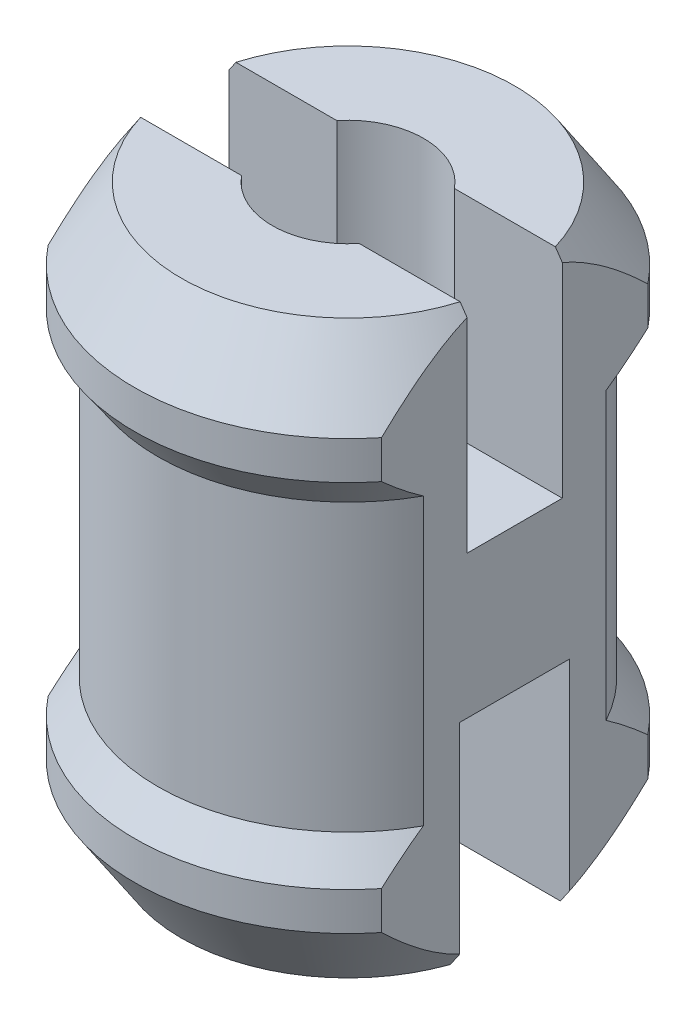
ISO-10303-21;
HEADER;
FILE_DESCRIPTION(('STEP AP214'),'2;1');
FILE_NAME('part.step','',(''),(''),'','','');
FILE_SCHEMA(('AUTOMOTIVE_DESIGN { 1 0 10303 214 1 1 1 1 }'));
ENDSEC;
DATA;
#1=APPLICATION_CONTEXT('core data for automotive mechanical design processes');
#2=APPLICATION_PROTOCOL_DEFINITION('international standard','automotive_design',2000,#1);
#3=PRODUCT_CONTEXT('',#1,'mechanical');
#4=PRODUCT('Part','Part','',(#3));
#5=PRODUCT_RELATED_PRODUCT_CATEGORY('part','',(#4));
#6=PRODUCT_DEFINITION_FORMATION('','',#4);
#7=PRODUCT_DEFINITION_CONTEXT('part definition',#1,'design');
#8=PRODUCT_DEFINITION('design','',#6,#7);
#9=PRODUCT_DEFINITION_SHAPE('','',#8);
#10=(LENGTH_UNIT() NAMED_UNIT(*) SI_UNIT(.MILLI.,.METRE.));
#11=(NAMED_UNIT(*) PLANE_ANGLE_UNIT() SI_UNIT($,.RADIAN.));
#12=(NAMED_UNIT(*) SI_UNIT($,.STERADIAN.) SOLID_ANGLE_UNIT());
#13=UNCERTAINTY_MEASURE_WITH_UNIT(LENGTH_MEASURE(1.E-05),#10,'distance_accuracy_value','');
#14=(GEOMETRIC_REPRESENTATION_CONTEXT(3) GLOBAL_UNCERTAINTY_ASSIGNED_CONTEXT((#13)) GLOBAL_UNIT_ASSIGNED_CONTEXT((#10,
#11,#12)) REPRESENTATION_CONTEXT('',''));
#15=CARTESIAN_POINT('',(0.,0.,0.));
#16=DIRECTION('',(0.,0.,1.));
#17=DIRECTION('',(1.,0.,0.));
#18=AXIS2_PLACEMENT_3D('',#15,#16,#17);
#19=CARTESIAN_POINT('',(-20.5359784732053,11.5,17.9328195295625));
#20=DIRECTION('',(0.,1.,0.));
#21=DIRECTION('',(0.,0.,1.));
#22=AXIS2_PLACEMENT_3D('',#19,#20,#21);
#23=CYLINDRICAL_SURFACE('',#22,1.58900472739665);
#24=CARTESIAN_POINT('',(-20.5359784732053,8.49999999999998,17.9328195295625));
#25=DIRECTION('',(0.,1.,0.));
#26=DIRECTION('',(0.,0.,1.));
#27=AXIS2_PLACEMENT_3D('',#24,#25,#26);
#28=CIRCLE('',#27,1.58900472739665);
#29=CARTESIAN_POINT('',(-19.4446678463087,8.49999999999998,16.7778402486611));
#30=VERTEX_POINT('',#29);
#31=CARTESIAN_POINT('',(-21.6272891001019,8.49999999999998,16.7778402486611));
#32=VERTEX_POINT('',#31);
#33=EDGE_CURVE('E287',#30,#32,#28,.T.);
#34=ORIENTED_EDGE('',*,*,#33,.T.);
#35=DIRECTION('',(0.,1.,0.));
#36=VECTOR('',#35,1.);
#37=CARTESIAN_POINT('',(-21.6272891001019,11.5,16.7778402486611));
#38=LINE('',#37,#36);
#39=CARTESIAN_POINT('',(-21.6272891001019,3.99999999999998,16.7778402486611));
#40=VERTEX_POINT('',#39);
#41=EDGE_CURVE('E648',#32,#40,#38,.F.);
#42=ORIENTED_EDGE('',*,*,#41,.T.);
#43=CARTESIAN_POINT('',(-20.5359784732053,3.99999999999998,17.9328195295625));
#44=DIRECTION('',(0.,1.,0.));
#45=DIRECTION('',(0.,0.,1.));
#46=AXIS2_PLACEMENT_3D('',#43,#44,#45);
#47=CIRCLE('',#46,1.58900472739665);
#48=CARTESIAN_POINT('',(-19.4446678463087,3.99999999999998,16.7778402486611));
#49=VERTEX_POINT('',#48);
#50=EDGE_CURVE('E277',#49,#40,#47,.T.);
#51=ORIENTED_EDGE('',*,*,#50,.F.);
#52=DIRECTION('',(0.,1.,0.));
#53=VECTOR('',#52,1.);
#54=CARTESIAN_POINT('',(-19.4446678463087,11.5,16.7778402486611));
#55=LINE('',#54,#53);
#56=EDGE_CURVE('E632',#49,#30,#55,.T.);
#57=ORIENTED_EDGE('',*,*,#56,.T.);
#58=EDGE_LOOP('',(#34,#42,#51,#57));
#59=FACE_BOUND('',#58,.T.);
#60=ADVANCED_FACE('F50',(#59),#23,.F.);
#61=CARTESIAN_POINT('',(-17.0359786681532,3.99999999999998,17.9328195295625));
#62=DIRECTION('',(0.,1.,0.));
#63=DIRECTION('',(0.,0.,1.));
#64=AXIS2_PLACEMENT_3D('',#61,#62,#63);
#65=PLANE('',#64);
#66=CARTESIAN_POINT('',(-20.5359784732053,3.99999999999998,17.9328195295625));
#67=DIRECTION('',(0.,1.,0.));
#68=DIRECTION('',(0.,0.,1.));
#69=AXIS2_PLACEMENT_3D('',#66,#67,#68);
#70=CIRCLE('',#69,3.49999980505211);
#71=CARTESIAN_POINT('',(-17.2320381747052,3.99999999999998,16.7778402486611));
#72=VERTEX_POINT('',#71);
#73=CARTESIAN_POINT('',(-23.8399187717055,3.99999999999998,16.7778402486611));
#74=VERTEX_POINT('',#73);
#75=EDGE_CURVE('E278',#72,#74,#70,.T.);
#76=ORIENTED_EDGE('',*,*,#75,.F.);
#77=DIRECTION('',(-1.,0.,0.));
#78=VECTOR('',#77,1.);
#79=CARTESIAN_POINT('',(-17.0359786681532,3.99999999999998,16.7778402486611));
#80=LINE('',#79,#78);
#81=EDGE_CURVE('E12',#72,#49,#80,.T.);
#82=ORIENTED_EDGE('',*,*,#81,.T.);
#83=ORIENTED_EDGE('',*,*,#50,.T.);
#84=EDGE_CURVE('E54',#40,#74,#80,.T.);
#85=ORIENTED_EDGE('',*,*,#84,.T.);
#86=EDGE_LOOP('',(#76,#82,#83,#85));
#87=FACE_BOUND('',#86,.T.);
#88=ADVANCED_FACE('F553',(#87),#65,.F.);
#89=CARTESIAN_POINT('',(-20.5359784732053,14.5,17.9328195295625));
#90=DIRECTION('',(0.,-1.,0.));
#91=DIRECTION('',(0.,0.,-1.));
#92=AXIS2_PLACEMENT_3D('',#89,#90,#91);
#93=CONICAL_SURFACE('',#92,4.48005192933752,0.578739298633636);
#94=CARTESIAN_POINT('',(-13.3182987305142,10.2044536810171,16.9328195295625));
#95=CARTESIAN_POINT('',(-13.525479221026,10.5185369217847,16.9328195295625));
#96=CARTESIAN_POINT('',(-13.7327659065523,10.832550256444,16.9328195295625));
#97=CARTESIAN_POINT('',(-14.1476528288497,11.460379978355,16.9328195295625));
#98=CARTESIAN_POINT('',(-14.3552530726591,11.7741963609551,16.9328195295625));
#99=CARTESIAN_POINT('',(-14.7711398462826,12.401984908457,16.9328195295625));
#100=CARTESIAN_POINT('',(-14.9794269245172,12.715956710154,16.9328195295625));
#101=CARTESIAN_POINT('',(-15.396561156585,13.3435187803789,16.9328195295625));
#102=CARTESIAN_POINT('',(-15.6054082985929,13.6571090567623,16.9328195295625));
#103=CARTESIAN_POINT('',(-16.0417247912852,14.3104129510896,16.9328195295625));
#104=CARTESIAN_POINT('',(-16.2692662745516,14.6500784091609,16.9328195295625));
#105=CARTESIAN_POINT('',(-16.7258523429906,15.3284322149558,16.9328195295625));
#106=CARTESIAN_POINT('',(-16.9548970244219,15.6671204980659,16.9328195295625));
#107=CARTESIAN_POINT('',(-17.3002842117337,16.1736523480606,16.9328195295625));
#108=CARTESIAN_POINT('',(-17.415655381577,16.3421578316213,16.9328195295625));
#109=CARTESIAN_POINT('',(-17.6472942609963,16.678550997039,16.9328195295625));
#110=CARTESIAN_POINT('',(-17.7635619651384,16.8464386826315,16.9328195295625));
#111=CARTESIAN_POINT('',(-17.9973552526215,17.1813093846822,16.9328195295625));
#112=CARTESIAN_POINT('',(-18.1148806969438,17.3482924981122,16.9328195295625));
#113=CARTESIAN_POINT('',(-18.3518063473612,17.68092161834,16.9328195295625));
#114=CARTESIAN_POINT('',(-18.471206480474,17.8465676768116,16.9328195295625));
#115=CARTESIAN_POINT('',(-18.6400204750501,18.0763093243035,16.9328195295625));
#116=CARTESIAN_POINT('',(-18.6881660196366,18.1413363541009,16.9328195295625));
#117=CARTESIAN_POINT('',(-18.7850498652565,18.2709514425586,16.9328195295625));
#118=CARTESIAN_POINT('',(-18.8337881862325,18.3355394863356,16.9328195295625));
#119=CARTESIAN_POINT('',(-18.9320775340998,18.4642554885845,16.9328195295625));
#120=CARTESIAN_POINT('',(-18.9816297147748,18.5283825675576,16.9328195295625));
#121=CARTESIAN_POINT('',(-19.0816704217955,18.6558961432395,16.9328195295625));
#122=CARTESIAN_POINT('',(-19.1321588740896,18.719282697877,16.9328195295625));
#123=CARTESIAN_POINT('',(-19.2337312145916,18.8442934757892,16.9328195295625));
#124=CARTESIAN_POINT('',(-19.2848001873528,18.9059297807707,16.9328195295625));
#125=CARTESIAN_POINT('',(-19.3885189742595,19.0278557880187,16.9328195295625));
#126=CARTESIAN_POINT('',(-19.4411686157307,19.0881456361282,16.9328195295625));
#127=CARTESIAN_POINT('',(-19.5485193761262,19.2066421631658,16.9328195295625));
#128=CARTESIAN_POINT('',(-19.6032158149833,19.2648530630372,16.9328195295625));
#129=CARTESIAN_POINT('',(-19.7156195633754,19.3782730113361,16.9328195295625));
#130=CARTESIAN_POINT('',(-19.7733243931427,19.4334844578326,16.9328195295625));
#131=CARTESIAN_POINT('',(-19.8546114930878,19.5050031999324,16.9328195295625));
#132=CARTESIAN_POINT('',(-19.8762694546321,19.5234930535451,16.9328195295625));
#133=CARTESIAN_POINT('',(-19.92024036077,19.5596800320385,16.9328195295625));
#134=CARTESIAN_POINT('',(-19.9425533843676,19.5773770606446,16.9328195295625));
#135=CARTESIAN_POINT('',(-20.0107257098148,19.6291037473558,16.9328195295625));
#136=CARTESIAN_POINT('',(-20.0577215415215,19.6616815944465,16.9328195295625));
#137=CARTESIAN_POINT('',(-20.1563363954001,19.7212420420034,16.9328195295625));
#138=CARTESIAN_POINT('',(-20.2080196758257,19.7481217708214,16.9328195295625));
#139=CARTESIAN_POINT('',(-20.3155302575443,19.7915405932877,16.9328195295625));
#140=CARTESIAN_POINT('',(-20.3713311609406,19.8081400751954,16.9328195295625));
#141=CARTESIAN_POINT('',(-20.466418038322,19.8237283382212,16.9328195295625));
#142=CARTESIAN_POINT('',(-20.5050356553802,19.8267344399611,16.9328195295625));
#143=CARTESIAN_POINT('',(-20.5821882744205,19.8258299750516,16.9328195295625));
#144=CARTESIAN_POINT('',(-20.6207232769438,19.8219194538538,16.9328195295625));
#145=CARTESIAN_POINT('',(-20.7051126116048,19.806198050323,16.9328195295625));
#146=CARTESIAN_POINT('',(-20.7506643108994,19.7928083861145,16.9328195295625));
#147=CARTESIAN_POINT('',(-20.8390558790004,19.7589329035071,16.9328195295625));
#148=CARTESIAN_POINT('',(-20.88188706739,19.7384256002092,16.9328195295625));
#149=CARTESIAN_POINT('',(-20.974140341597,19.6874298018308,16.9328195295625));
#150=CARTESIAN_POINT('',(-21.0228774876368,19.6557337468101,16.9328195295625));
#151=CARTESIAN_POINT('',(-21.1171159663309,19.5877911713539,16.9328195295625));
#152=CARTESIAN_POINT('',(-21.162610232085,19.551535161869,16.9328195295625));
#153=CARTESIAN_POINT('',(-21.2514004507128,19.4758216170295,16.9328195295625));
#154=CARTESIAN_POINT('',(-21.2946776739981,19.4363424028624,16.9328195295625));
#155=CARTESIAN_POINT('',(-21.3792465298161,19.3554196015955,16.9328195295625));
#156=CARTESIAN_POINT('',(-21.4205401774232,19.3139780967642,16.9328195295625));
#157=CARTESIAN_POINT('',(-21.5057999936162,19.2253625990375,16.9328195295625));
#158=CARTESIAN_POINT('',(-21.5496067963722,19.1780361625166,16.9328195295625));
#159=CARTESIAN_POINT('',(-21.6358540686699,19.082150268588,16.9328195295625));
#160=CARTESIAN_POINT('',(-21.6782943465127,19.0335906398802,16.9328195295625));
#161=CARTESIAN_POINT('',(-21.8040811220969,18.886518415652,16.9328195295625));
#162=CARTESIAN_POINT('',(-21.8858495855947,18.7866596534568,16.9328195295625));
#163=CARTESIAN_POINT('',(-22.0468835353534,18.5846390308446,16.9328195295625));
#164=CARTESIAN_POINT('',(-22.1261435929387,18.4824728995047,16.9328195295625));
#165=CARTESIAN_POINT('',(-22.2828193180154,18.2767871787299,16.9328195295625));
#166=CARTESIAN_POINT('',(-22.3602355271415,18.173268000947,16.9328195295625));
#167=CARTESIAN_POINT('',(-22.5136271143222,17.9654879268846,16.9328195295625));
#168=CARTESIAN_POINT('',(-22.5896050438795,17.861228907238,16.9328195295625));
#169=CARTESIAN_POINT('',(-22.7406186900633,17.6520201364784,16.9328195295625));
#170=CARTESIAN_POINT('',(-22.8156543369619,17.547070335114,16.9328195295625));
#171=CARTESIAN_POINT('',(-23.0395183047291,17.2317208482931,16.9328195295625));
#172=CARTESIAN_POINT('',(-23.1872870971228,17.0205698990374,16.9328195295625));
#173=CARTESIAN_POINT('',(-23.5235577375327,16.5359060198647,16.9328195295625));
#174=CARTESIAN_POINT('',(-23.7114930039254,16.2620015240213,16.9328195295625));
#175=CARTESIAN_POINT('',(-24.0856816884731,15.7130406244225,16.9328195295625));
#176=CARTESIAN_POINT('',(-24.2719350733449,15.4379841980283,16.9328195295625));
#177=CARTESIAN_POINT('',(-24.6434549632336,14.8869898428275,16.9328195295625));
#178=CARTESIAN_POINT('',(-24.8287208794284,14.6110515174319,16.9328195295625));
#179=CARTESIAN_POINT('',(-25.198511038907,14.0586817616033,16.9328195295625));
#180=CARTESIAN_POINT('',(-25.3830352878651,13.7822503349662,16.9328195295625));
#181=CARTESIAN_POINT('',(-25.750283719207,13.2309481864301,16.9328195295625));
#182=CARTESIAN_POINT('',(-25.9330115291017,12.9560798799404,16.9328195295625));
#183=CARTESIAN_POINT('',(-26.2980839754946,12.4060879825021,16.9328195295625));
#184=CARTESIAN_POINT('',(-26.4804286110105,12.1309643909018,16.9328195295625));
#185=CARTESIAN_POINT('',(-26.8447159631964,11.5806938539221,16.9328195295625));
#186=CARTESIAN_POINT('',(-27.0266588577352,11.3055470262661,16.9328195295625));
#187=CARTESIAN_POINT('',(-27.3903152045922,10.7551031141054,16.9328195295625));
#188=CARTESIAN_POINT('',(-27.5720286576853,10.4798060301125,16.9328195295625));
#189=CARTESIAN_POINT('',(-27.7536582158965,10.2044536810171,16.9328195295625));
#190=B_SPLINE_CURVE_WITH_KNOTS('',3,(#94,#95,#96,#97,#98,#99,#100,#101,#102,#103,#104,#105,#106,
#107,#108,#109,#110,#111,#112,#113,#114,#115,#116,#117,#118,#119,#120,#121,#122,#123,#124,#125,
#126,#127,#128,#129,#130,#131,#132,#133,#134,#135,#136,#137,#138,#139,#140,#141,#142,#143,#144,
#145,#146,#147,#148,#149,#150,#151,#152,#153,#154,#155,#156,#157,#158,#159,#160,#161,#162,#163,
#164,#165,#166,#167,#168,#169,#170,#171,#172,#173,#174,#175,#176,#177,#178,#179,#180,#181,#182,
#183,#184,#185,#186,#187,#188,#189),.UNSPECIFIED.,.F.,.F.,(4,2,2,2,2,2,2,2,2,2,2,2,2,2,2,2,2,2,
2,2,2,2,2,2,2,2,2,2,2,2,2,2,2,2,2,2,2,2,2,2,2,2,2,2,2,2,2,4),(0.,1.12878195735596,
2.25758964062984,3.38792379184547,4.518234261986,5.74474378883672,6.97133263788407,
7.58398194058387,8.19662753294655,8.80920609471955,9.42176086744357,9.66448981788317,
9.90722695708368,10.1503444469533,10.3934427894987,10.6335572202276,10.8736455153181,
11.1132148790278,11.3525897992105,11.438004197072,11.5234289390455,11.694668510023,
11.8687766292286,12.0418520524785,12.157460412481,12.2730680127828,12.4146717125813,
12.5567066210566,12.7306944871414,12.9050505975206,13.0806951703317,13.2561573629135,
13.4495879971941,13.6430456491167,14.0301542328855,14.4180501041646,14.8058305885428,
15.1928425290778,15.5798829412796,16.3530307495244,17.3495600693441,18.3461090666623,
19.3431975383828,20.3402783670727,21.3304690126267,22.3206621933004,23.3102483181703,
24.2998310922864),.UNSPECIFIED.);
#191=CARTESIAN_POINT('',(-17.0359784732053,15.7856412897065,16.9328195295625));
#192=VERTEX_POINT('',#191);
#193=CARTESIAN_POINT('',(-17.1818767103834,16.,16.9328195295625));
#194=VERTEX_POINT('',#193);
#195=EDGE_CURVE('E529',#192,#194,#190,.T.);
#196=ORIENTED_EDGE('',*,*,#195,.F.);
#197=CARTESIAN_POINT('',(-17.0359784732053,10.2198692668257,11.5533038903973));
#198=CARTESIAN_POINT('',(-17.0359784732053,10.4058142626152,11.6918997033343));
#199=CARTESIAN_POINT('',(-17.0359784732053,10.5912820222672,11.8311419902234));
#200=CARTESIAN_POINT('',(-17.0359784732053,10.9610158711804,12.1112567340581));
#201=CARTESIAN_POINT('',(-17.0359784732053,11.1452818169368,12.252129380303));
#202=CARTESIAN_POINT('',(-17.0359784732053,11.513209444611,12.5364962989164));
#203=CARTESIAN_POINT('',(-17.0359784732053,11.696863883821,12.6799999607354));
#204=CARTESIAN_POINT('',(-17.0359784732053,12.0622609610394,12.9694024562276));
#205=CARTESIAN_POINT('',(-17.0359784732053,12.2440037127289,13.1153011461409));
#206=CARTESIAN_POINT('',(-17.0359784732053,12.615692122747,13.4187783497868));
#207=CARTESIAN_POINT('',(-17.0359784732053,12.8054900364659,13.5765384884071));
#208=CARTESIAN_POINT('',(-17.0359784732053,13.1814087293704,13.896367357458));
#209=CARTESIAN_POINT('',(-17.0359784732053,13.3675297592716,14.0584357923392));
#210=CARTESIAN_POINT('',(-17.0359784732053,13.734346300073,14.387927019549));
#211=CARTESIAN_POINT('',(-17.0359784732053,13.9150519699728,14.5553383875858));
#212=CARTESIAN_POINT('',(-17.0359784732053,14.1805447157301,14.8121551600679));
#213=CARTESIAN_POINT('',(-17.0359784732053,14.2681010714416,14.8986963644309));
#214=CARTESIAN_POINT('',(-17.0359784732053,14.4409273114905,15.0740281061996));
#215=CARTESIAN_POINT('',(-17.0359784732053,14.5261973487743,15.1628184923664));
#216=CARTESIAN_POINT('',(-17.0359784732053,14.7048740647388,15.3548446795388));
#217=CARTESIAN_POINT('',(-17.0359784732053,14.7978855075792,15.4584504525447));
#218=CARTESIAN_POINT('',(-17.0359784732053,14.9791966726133,15.669807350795));
#219=CARTESIAN_POINT('',(-17.0359784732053,15.0674944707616,15.7775601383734));
#220=CARTESIAN_POINT('',(-17.0359784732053,15.237168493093,15.9973021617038));
#221=CARTESIAN_POINT('',(-17.0359784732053,15.3185864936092,16.1092588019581));
#222=CARTESIAN_POINT('',(-17.0359784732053,15.4727918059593,16.3389209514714));
#223=CARTESIAN_POINT('',(-17.0359784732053,15.5455854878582,16.4566221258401));
#224=CARTESIAN_POINT('',(-17.0359784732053,15.6864312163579,16.7114658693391));
#225=CARTESIAN_POINT('',(-17.0359784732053,15.7531732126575,16.8493495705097));
#226=CARTESIAN_POINT('',(-17.0359784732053,15.8660433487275,17.133478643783));
#227=CARTESIAN_POINT('',(-17.0359784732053,15.9122031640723,17.2797107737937));
#228=CARTESIAN_POINT('',(-17.0359784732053,15.9612814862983,17.5045923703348));
#229=CARTESIAN_POINT('',(-17.0359784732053,15.9743006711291,17.5810804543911));
#230=CARTESIAN_POINT('',(-17.0359784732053,15.992730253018,17.734984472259));
#231=CARTESIAN_POINT('',(-17.0359784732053,15.9981415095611,17.8124003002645));
#232=CARTESIAN_POINT('',(-17.0359784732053,16.0010506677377,17.9673079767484));
#233=CARTESIAN_POINT('',(-17.0359784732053,15.9985559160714,18.0447996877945));
#234=CARTESIAN_POINT('',(-17.0359784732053,15.9858093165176,18.19914149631));
#235=CARTESIAN_POINT('',(-17.0359784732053,15.9755565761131,18.2759915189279));
#236=CARTESIAN_POINT('',(-17.0359784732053,15.9470093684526,18.4327814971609));
#237=CARTESIAN_POINT('',(-17.0359784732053,15.9282827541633,18.5126419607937));
#238=CARTESIAN_POINT('',(-17.0359784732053,15.8836486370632,18.6703375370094));
#239=CARTESIAN_POINT('',(-17.0359784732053,15.8577380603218,18.7481717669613));
#240=CARTESIAN_POINT('',(-17.0359784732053,15.7996971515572,18.90172703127));
#241=CARTESIAN_POINT('',(-17.0359784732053,15.7675483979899,18.977441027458));
#242=CARTESIAN_POINT('',(-17.0359784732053,15.6980945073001,19.1264414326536));
#243=CARTESIAN_POINT('',(-17.0359784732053,15.6607893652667,19.1997278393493));
#244=CARTESIAN_POINT('',(-17.0359784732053,15.5736546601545,19.3590585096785));
#245=CARTESIAN_POINT('',(-17.0359784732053,15.5228383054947,19.4445604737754));
#246=CARTESIAN_POINT('',(-17.0359784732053,15.4162529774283,19.6124364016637));
#247=CARTESIAN_POINT('',(-17.0359784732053,15.3604819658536,19.6948090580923));
#248=CARTESIAN_POINT('',(-17.0359784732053,15.2449233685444,19.8568604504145));
#249=CARTESIAN_POINT('',(-17.0359784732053,15.1851297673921,19.9365348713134));
#250=CARTESIAN_POINT('',(-17.0359784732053,15.0623742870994,20.093407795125));
#251=CARTESIAN_POINT('',(-17.0359784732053,14.9994119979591,20.1706059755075));
#252=CARTESIAN_POINT('',(-17.0359784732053,14.8700782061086,20.3238317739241));
#253=CARTESIAN_POINT('',(-17.0359784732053,14.8036727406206,20.3998306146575));
#254=CARTESIAN_POINT('',(-17.0359784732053,14.6687072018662,20.5498877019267));
#255=CARTESIAN_POINT('',(-17.0359784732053,14.6001470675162,20.6239458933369));
#256=CARTESIAN_POINT('',(-17.0359784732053,14.461319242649,20.7702911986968));
#257=CARTESIAN_POINT('',(-17.0359784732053,14.3910534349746,20.8425801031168));
#258=CARTESIAN_POINT('',(-17.0359784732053,14.2490359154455,20.9856732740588));
#259=CARTESIAN_POINT('',(-17.0359784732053,14.1772842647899,21.0564776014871));
#260=CARTESIAN_POINT('',(-17.0359784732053,13.936265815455,21.2901124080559));
#261=CARTESIAN_POINT('',(-17.0359784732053,13.7642292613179,21.4500878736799));
#262=CARTESIAN_POINT('',(-17.0359784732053,13.4154216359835,21.7648080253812));
#263=CARTESIAN_POINT('',(-17.0359784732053,13.2386496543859,21.9195516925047));
#264=CARTESIAN_POINT('',(-17.0359784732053,12.881553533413,22.225086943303));
#265=CARTESIAN_POINT('',(-17.0359784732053,12.7012273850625,22.3758761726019));
#266=CARTESIAN_POINT('',(-17.0359784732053,12.3379714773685,22.6742875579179));
#267=CARTESIAN_POINT('',(-17.0359784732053,12.155041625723,22.8219096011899));
#268=CARTESIAN_POINT('',(-17.0359784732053,11.7866386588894,23.1150459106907));
#269=CARTESIAN_POINT('',(-17.0359784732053,11.6011597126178,23.2605528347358));
#270=CARTESIAN_POINT('',(-17.0359784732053,11.2285975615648,23.5495004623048));
#271=CARTESIAN_POINT('',(-17.0359784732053,11.0415143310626,23.6929411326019));
#272=CARTESIAN_POINT('',(-17.0359784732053,10.4784835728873,24.1206301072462));
#273=CARTESIAN_POINT('',(-17.0359784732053,10.1006183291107,24.4023530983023));
#274=CARTESIAN_POINT('',(-17.0359784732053,9.38672642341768,24.9277613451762));
#275=CARTESIAN_POINT('',(-17.0359784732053,9.05108654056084,25.1719747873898));
#276=CARTESIAN_POINT('',(-17.0359784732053,8.37777134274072,25.6576521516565));
#277=CARTESIAN_POINT('',(-17.0359784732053,8.04009581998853,25.8991157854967));
#278=CARTESIAN_POINT('',(-17.0359784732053,7.36509282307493,26.3785770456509));
#279=CARTESIAN_POINT('',(-17.0359784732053,7.0277736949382,26.6165864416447));
#280=CARTESIAN_POINT('',(-17.0359784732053,6.35198592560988,27.0908739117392));
#281=CARTESIAN_POINT('',(-17.0359784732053,6.01351744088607,27.3271522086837));
#282=CARTESIAN_POINT('',(-17.0359784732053,5.67460586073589,27.5627889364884));
#283=B_SPLINE_CURVE_WITH_KNOTS('',3,(#197,#198,#199,#200,#201,#202,#203,#204,#205,#206,#207,
#208,#209,#210,#211,#212,#213,#214,#215,#216,#217,#218,#219,#220,#221,#222,#223,#224,#225,#226,
#227,#228,#229,#230,#231,#232,#233,#234,#235,#236,#237,#238,#239,#240,#241,#242,#243,#244,#245,
#246,#247,#248,#249,#250,#251,#252,#253,#254,#255,#256,#257,#258,#259,#260,#261,#262,#263,#264,
#265,#266,#267,#268,#269,#270,#271,#272,#273,#274,#275,#276,#277,#278,#279,#280,#281,#282),
.UNSPECIFIED.,.F.,.F.,(4,2,2,2,2,2,2,2,2,2,2,2,2,2,2,2,2,2,2,2,2,2,2,2,2,2,2,2,2,2,2,2,2,2,2,2,
2,2,2,2,2,2,4),(0.,0.695747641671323,1.39157689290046,2.09077440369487,2.78993009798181,
3.53028680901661,4.27059286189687,5.0094100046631,5.3787001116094,5.74796545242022,
6.16554774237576,6.58329920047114,6.99829783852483,7.41298801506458,7.8714196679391,
8.32914334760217,8.56157992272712,8.79399023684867,9.02618464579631,9.25840577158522,
9.50410308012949,9.7499056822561,9.99644550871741,10.2429855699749,10.541155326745,
10.8394483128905,11.138197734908,11.4369859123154,11.7397064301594,12.0424355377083,
12.3448444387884,12.647240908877,13.351837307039,14.0565701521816,14.761713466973,
15.4668818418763,16.1740923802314,16.8813142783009,18.2952361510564,19.5404725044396,
20.7858381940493,22.0243375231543,23.2626745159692),.UNSPECIFIED.);
#284=CARTESIAN_POINT('',(-17.0359784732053,14.5,15.1362385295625));
#285=VERTEX_POINT('',#284);
#286=EDGE_CURVE('E454',#192,#285,#283,.F.);
#287=ORIENTED_EDGE('',*,*,#286,.T.);
#288=CARTESIAN_POINT('',(-20.5359784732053,14.5,17.9328195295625));
#289=DIRECTION('',(0.,1.,0.));
#290=DIRECTION('',(0.,0.,1.));
#291=AXIS2_PLACEMENT_3D('',#288,#289,#290);
#292=CIRCLE('',#291,4.48005192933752);
#293=CARTESIAN_POINT('',(-24.0359784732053,14.5,15.1362385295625));
#294=VERTEX_POINT('',#293);
#295=EDGE_CURVE('E300',#285,#294,#292,.T.);
#296=ORIENTED_EDGE('',*,*,#295,.T.);
#297=CARTESIAN_POINT('',(-24.0359784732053,10.2198692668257,11.5533038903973));
#298=CARTESIAN_POINT('',(-24.0359784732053,10.4058142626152,11.6918997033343));
#299=CARTESIAN_POINT('',(-24.0359784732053,10.5912820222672,11.8311419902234));
#300=CARTESIAN_POINT('',(-24.0359784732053,10.9610158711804,12.1112567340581));
#301=CARTESIAN_POINT('',(-24.0359784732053,11.1452818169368,12.252129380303));
#302=CARTESIAN_POINT('',(-24.0359784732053,11.513209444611,12.5364962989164));
#303=CARTESIAN_POINT('',(-24.0359784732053,11.696863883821,12.6799999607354));
#304=CARTESIAN_POINT('',(-24.0359784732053,12.0622609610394,12.9694024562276));
#305=CARTESIAN_POINT('',(-24.0359784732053,12.2440037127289,13.1153011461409));
#306=CARTESIAN_POINT('',(-24.0359784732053,12.615692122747,13.4187783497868));
#307=CARTESIAN_POINT('',(-24.0359784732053,12.8054900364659,13.5765384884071));
#308=CARTESIAN_POINT('',(-24.0359784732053,13.1814087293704,13.896367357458));
#309=CARTESIAN_POINT('',(-24.0359784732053,13.3675297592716,14.0584357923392));
#310=CARTESIAN_POINT('',(-24.0359784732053,13.734346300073,14.387927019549));
#311=CARTESIAN_POINT('',(-24.0359784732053,13.9150519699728,14.5553383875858));
#312=CARTESIAN_POINT('',(-24.0359784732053,14.1805447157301,14.8121551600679));
#313=CARTESIAN_POINT('',(-24.0359784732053,14.2681010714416,14.8986963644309));
#314=CARTESIAN_POINT('',(-24.0359784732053,14.4409273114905,15.0740281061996));
#315=CARTESIAN_POINT('',(-24.0359784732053,14.5261973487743,15.1628184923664));
#316=CARTESIAN_POINT('',(-24.0359784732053,14.7048740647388,15.3548446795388));
#317=CARTESIAN_POINT('',(-24.0359784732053,14.7978855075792,15.4584504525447));
#318=CARTESIAN_POINT('',(-24.0359784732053,14.9791966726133,15.669807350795));
#319=CARTESIAN_POINT('',(-24.0359784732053,15.0674944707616,15.7775601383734));
#320=CARTESIAN_POINT('',(-24.0359784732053,15.237168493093,15.9973021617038));
#321=CARTESIAN_POINT('',(-24.0359784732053,15.3185864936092,16.1092588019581));
#322=CARTESIAN_POINT('',(-24.0359784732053,15.4727918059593,16.3389209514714));
#323=CARTESIAN_POINT('',(-24.0359784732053,15.5455854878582,16.4566221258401));
#324=CARTESIAN_POINT('',(-24.0359784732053,15.6864312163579,16.7114658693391));
#325=CARTESIAN_POINT('',(-24.0359784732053,15.7531732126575,16.8493495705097));
#326=CARTESIAN_POINT('',(-24.0359784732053,15.8660433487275,17.133478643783));
#327=CARTESIAN_POINT('',(-24.0359784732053,15.9122031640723,17.2797107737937));
#328=CARTESIAN_POINT('',(-24.0359784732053,15.9612814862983,17.5045923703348));
#329=CARTESIAN_POINT('',(-24.0359784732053,15.9743006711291,17.5810804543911));
#330=CARTESIAN_POINT('',(-24.0359784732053,15.992730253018,17.734984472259));
#331=CARTESIAN_POINT('',(-24.0359784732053,15.9981415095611,17.8124003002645));
#332=CARTESIAN_POINT('',(-24.0359784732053,16.0010506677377,17.9673079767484));
#333=CARTESIAN_POINT('',(-24.0359784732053,15.9985559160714,18.0447996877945));
#334=CARTESIAN_POINT('',(-24.0359784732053,15.9858093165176,18.19914149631));
#335=CARTESIAN_POINT('',(-24.0359784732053,15.9755565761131,18.2759915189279));
#336=CARTESIAN_POINT('',(-24.0359784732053,15.9470093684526,18.4327814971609));
#337=CARTESIAN_POINT('',(-24.0359784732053,15.9282827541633,18.5126419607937));
#338=CARTESIAN_POINT('',(-24.0359784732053,15.8836486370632,18.6703375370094));
#339=CARTESIAN_POINT('',(-24.0359784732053,15.8577380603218,18.7481717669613));
#340=CARTESIAN_POINT('',(-24.0359784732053,15.7996971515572,18.90172703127));
#341=CARTESIAN_POINT('',(-24.0359784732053,15.7675483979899,18.977441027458));
#342=CARTESIAN_POINT('',(-24.0359784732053,15.6980945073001,19.1264414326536));
#343=CARTESIAN_POINT('',(-24.0359784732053,15.6607893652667,19.1997278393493));
#344=CARTESIAN_POINT('',(-24.0359784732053,15.5736546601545,19.3590585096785));
#345=CARTESIAN_POINT('',(-24.0359784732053,15.5228383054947,19.4445604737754));
#346=CARTESIAN_POINT('',(-24.0359784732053,15.4162529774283,19.6124364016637));
#347=CARTESIAN_POINT('',(-24.0359784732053,15.3604819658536,19.6948090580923));
#348=CARTESIAN_POINT('',(-24.0359784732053,15.2449233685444,19.8568604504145));
#349=CARTESIAN_POINT('',(-24.0359784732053,15.1851297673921,19.9365348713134));
#350=CARTESIAN_POINT('',(-24.0359784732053,15.0623742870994,20.093407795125));
#351=CARTESIAN_POINT('',(-24.0359784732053,14.9994119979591,20.1706059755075));
#352=CARTESIAN_POINT('',(-24.0359784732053,14.8700782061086,20.3238317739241));
#353=CARTESIAN_POINT('',(-24.0359784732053,14.8036727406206,20.3998306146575));
#354=CARTESIAN_POINT('',(-24.0359784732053,14.6687072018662,20.5498877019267));
#355=CARTESIAN_POINT('',(-24.0359784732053,14.6001470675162,20.6239458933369));
#356=CARTESIAN_POINT('',(-24.0359784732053,14.461319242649,20.7702911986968));
#357=CARTESIAN_POINT('',(-24.0359784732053,14.3910534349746,20.8425801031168));
#358=CARTESIAN_POINT('',(-24.0359784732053,14.2490359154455,20.9856732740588));
#359=CARTESIAN_POINT('',(-24.0359784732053,14.1772842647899,21.0564776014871));
#360=CARTESIAN_POINT('',(-24.0359784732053,13.936265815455,21.2901124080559));
#361=CARTESIAN_POINT('',(-24.0359784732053,13.7642292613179,21.4500878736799));
#362=CARTESIAN_POINT('',(-24.0359784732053,13.4154216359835,21.7648080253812));
#363=CARTESIAN_POINT('',(-24.0359784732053,13.2386496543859,21.9195516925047));
#364=CARTESIAN_POINT('',(-24.0359784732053,12.881553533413,22.225086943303));
#365=CARTESIAN_POINT('',(-24.0359784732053,12.7012273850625,22.3758761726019));
#366=CARTESIAN_POINT('',(-24.0359784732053,12.3379714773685,22.6742875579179));
#367=CARTESIAN_POINT('',(-24.0359784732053,12.155041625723,22.8219096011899));
#368=CARTESIAN_POINT('',(-24.0359784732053,11.7866386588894,23.1150459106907));
#369=CARTESIAN_POINT('',(-24.0359784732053,11.6011597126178,23.2605528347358));
#370=CARTESIAN_POINT('',(-24.0359784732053,11.2285975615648,23.5495004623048));
#371=CARTESIAN_POINT('',(-24.0359784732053,11.0415143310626,23.6929411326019));
#372=CARTESIAN_POINT('',(-24.0359784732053,10.4784835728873,24.1206301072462));
#373=CARTESIAN_POINT('',(-24.0359784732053,10.1006183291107,24.4023530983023));
#374=CARTESIAN_POINT('',(-24.0359784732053,9.38672642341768,24.9277613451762));
#375=CARTESIAN_POINT('',(-24.0359784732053,9.05108654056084,25.1719747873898));
#376=CARTESIAN_POINT('',(-24.0359784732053,8.37777134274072,25.6576521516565));
#377=CARTESIAN_POINT('',(-24.0359784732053,8.04009581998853,25.8991157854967));
#378=CARTESIAN_POINT('',(-24.0359784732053,7.36509282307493,26.3785770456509));
#379=CARTESIAN_POINT('',(-24.0359784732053,7.0277736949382,26.6165864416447));
#380=CARTESIAN_POINT('',(-24.0359784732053,6.35198592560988,27.0908739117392));
#381=CARTESIAN_POINT('',(-24.0359784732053,6.01351744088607,27.3271522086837));
#382=CARTESIAN_POINT('',(-24.0359784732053,5.67460586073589,27.5627889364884));
#383=B_SPLINE_CURVE_WITH_KNOTS('',3,(#297,#298,#299,#300,#301,#302,#303,#304,#305,#306,#307,
#308,#309,#310,#311,#312,#313,#314,#315,#316,#317,#318,#319,#320,#321,#322,#323,#324,#325,#326,
#327,#328,#329,#330,#331,#332,#333,#334,#335,#336,#337,#338,#339,#340,#341,#342,#343,#344,#345,
#346,#347,#348,#349,#350,#351,#352,#353,#354,#355,#356,#357,#358,#359,#360,#361,#362,#363,#364,
#365,#366,#367,#368,#369,#370,#371,#372,#373,#374,#375,#376,#377,#378,#379,#380,#381,#382),
.UNSPECIFIED.,.F.,.F.,(4,2,2,2,2,2,2,2,2,2,2,2,2,2,2,2,2,2,2,2,2,2,2,2,2,2,2,2,2,2,2,2,2,2,2,2,
2,2,2,2,2,2,4),(0.,0.695747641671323,1.39157689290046,2.09077440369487,2.78993009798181,
3.53028680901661,4.27059286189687,5.0094100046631,5.3787001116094,5.74796545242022,
6.16554774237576,6.58329920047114,6.99829783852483,7.41298801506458,7.8714196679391,
8.32914334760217,8.56157992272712,8.79399023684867,9.02618464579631,9.25840577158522,
9.50410308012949,9.7499056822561,9.99644550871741,10.2429855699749,10.541155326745,
10.8394483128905,11.138197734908,11.4369859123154,11.7397064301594,12.0424355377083,
12.3448444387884,12.647240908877,13.351837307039,14.0565701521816,14.761713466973,
15.4668818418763,16.1740923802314,16.8813142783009,18.2952361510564,19.5404725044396,
20.7858381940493,22.0243375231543,23.2626745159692),.UNSPECIFIED.);
#384=CARTESIAN_POINT('',(-24.0359784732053,15.7856412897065,16.9328195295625));
#385=VERTEX_POINT('',#384);
#386=EDGE_CURVE('E438',#385,#294,#383,.F.);
#387=ORIENTED_EDGE('',*,*,#386,.F.);
#388=CARTESIAN_POINT('',(-23.8900802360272,16.,16.9328195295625));
#389=VERTEX_POINT('',#388);
#390=EDGE_CURVE('E596',#389,#385,#190,.T.);
#391=ORIENTED_EDGE('',*,*,#390,.F.);
#392=CARTESIAN_POINT('',(-20.5359784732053,16.,17.9328195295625));
#393=DIRECTION('',(0.,1.,0.));
#394=DIRECTION('',(0.,0.,1.));
#395=AXIS2_PLACEMENT_3D('',#392,#393,#394);
#396=CIRCLE('',#395,3.49999980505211);
#397=EDGE_CURVE('E299',#194,#389,#396,.T.);
#398=ORIENTED_EDGE('',*,*,#397,.F.);
#399=EDGE_LOOP('',(#196,#287,#296,#387,#391,#398));
#400=FACE_BOUND('',#399,.T.);
#401=ADVANCED_FACE('F416',(#400),#93,.T.);
#402=CARTESIAN_POINT('',(-17.0359786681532,16.,17.9328195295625));
#403=DIRECTION('',(0.,-1.,0.));
#404=DIRECTION('',(0.,0.,-1.));
#405=AXIS2_PLACEMENT_3D('',#402,#403,#404);
#406=PLANE('',#405);
#407=DIRECTION('',(1.,0.,0.));
#408=VECTOR('',#407,1.);
#409=CARTESIAN_POINT('',(-29.0265238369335,16.,16.9328195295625));
#410=LINE('',#409,#408);
#411=CARTESIAN_POINT('',(-19.3010954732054,16.,16.9328195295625));
#412=VERTEX_POINT('',#411);
#413=EDGE_CURVE('E494',#412,#194,#410,.T.);
#414=ORIENTED_EDGE('',*,*,#413,.T.);
#415=ORIENTED_EDGE('',*,*,#397,.T.);
#416=CARTESIAN_POINT('',(-21.7708614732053,16.,16.9328195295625));
#417=VERTEX_POINT('',#416);
#418=EDGE_CURVE('E504',#389,#417,#410,.T.);
#419=ORIENTED_EDGE('',*,*,#418,.T.);
#420=CARTESIAN_POINT('',(-20.5359784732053,16.,17.9328195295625));
#421=DIRECTION('',(0.,1.,0.));
#422=DIRECTION('',(0.,0.,1.));
#423=AXIS2_PLACEMENT_3D('',#420,#421,#422);
#424=CIRCLE('',#423,1.58900472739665);
#425=EDGE_CURVE('E295',#412,#417,#424,.T.);
#426=ORIENTED_EDGE('',*,*,#425,.F.);
#427=EDGE_LOOP('',(#414,#415,#419,#426));
#428=FACE_BOUND('',#427,.T.);
#429=ADVANCED_FACE('F512',(#428),#406,.F.);
#430=CARTESIAN_POINT('',(-20.5359784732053,11.5,17.9328195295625));
#431=DIRECTION('',(0.,1.,0.));
#432=DIRECTION('',(0.,0.,1.));
#433=AXIS2_PLACEMENT_3D('',#430,#431,#432);
#434=CYLINDRICAL_SURFACE('',#433,1.58900472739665);
#435=DIRECTION('',(0.,1.,0.));
#436=VECTOR('',#435,1.);
#437=CARTESIAN_POINT('',(-19.3010954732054,11.5,16.9328195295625));
#438=LINE('',#437,#436);
#439=CARTESIAN_POINT('',(-19.3010954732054,11.5,16.9328195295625));
#440=VERTEX_POINT('',#439);
#441=EDGE_CURVE('E522',#412,#440,#438,.F.);
#442=ORIENTED_EDGE('',*,*,#441,.F.);
#443=ORIENTED_EDGE('',*,*,#425,.T.);
#444=DIRECTION('',(0.,1.,0.));
#445=VECTOR('',#444,1.);
#446=CARTESIAN_POINT('',(-21.7708614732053,11.5,16.9328195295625));
#447=LINE('',#446,#445);
#448=CARTESIAN_POINT('',(-21.7708614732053,11.5,16.9328195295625));
#449=VERTEX_POINT('',#448);
#450=EDGE_CURVE('E520',#449,#417,#447,.T.);
#451=ORIENTED_EDGE('',*,*,#450,.F.);
#452=CARTESIAN_POINT('',(-20.5359784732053,11.5,17.9328195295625));
#453=DIRECTION('',(0.,1.,0.));
#454=DIRECTION('',(0.,0.,1.));
#455=AXIS2_PLACEMENT_3D('',#452,#453,#454);
#456=CIRCLE('',#455,1.58900472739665);
#457=EDGE_CURVE('E291',#440,#449,#456,.T.);
#458=ORIENTED_EDGE('',*,*,#457,.F.);
#459=EDGE_LOOP('',(#442,#443,#451,#458));
#460=FACE_BOUND('',#459,.T.);
#461=ADVANCED_FACE('F326',(#460),#434,.F.);
#462=CARTESIAN_POINT('',(-17.0359784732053,3.99999999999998,18.8541318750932));
#463=DIRECTION('',(-1.,0.,0.));
#464=DIRECTION('',(0.,0.,1.));
#465=AXIS2_PLACEMENT_3D('',#462,#463,#464);
#466=PLANE('',#465);
#467=DIRECTION('',(0.,0.,1.));
#468=VECTOR('',#467,1.);
#469=CARTESIAN_POINT('',(-17.0359784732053,8.49999999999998,18.8541318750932));
#470=LINE('',#469,#468);
#471=CARTESIAN_POINT('',(-17.0359784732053,8.49999999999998,16.7778402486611));
#472=VERTEX_POINT('',#471);
#473=CARTESIAN_POINT('',(-17.0359784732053,8.49999999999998,19.0877988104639));
#474=VERTEX_POINT('',#473);
#475=EDGE_CURVE('E482',#472,#474,#470,.T.);
#476=ORIENTED_EDGE('',*,*,#475,.F.);
#477=DIRECTION('',(0.,-1.,0.));
#478=VECTOR('',#477,1.);
#479=CARTESIAN_POINT('',(-17.0359784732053,3.99999999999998,16.7778402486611));
#480=LINE('',#479,#478);
#481=CARTESIAN_POINT('',(-17.0359784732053,4.28413529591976,16.7778402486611));
#482=VERTEX_POINT('',#481);
#483=EDGE_CURVE('E480',#472,#482,#480,.T.);
#484=ORIENTED_EDGE('',*,*,#483,.T.);
#485=CARTESIAN_POINT('',(-17.0359784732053,9.78013073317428,11.5533038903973));
#486=CARTESIAN_POINT('',(-17.0359784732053,9.59418573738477,11.6918997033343));
#487=CARTESIAN_POINT('',(-17.0359784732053,9.40871797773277,11.8311419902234));
#488=CARTESIAN_POINT('',(-17.0359784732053,9.03898412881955,12.1112567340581));
#489=CARTESIAN_POINT('',(-17.0359784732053,8.85471818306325,12.252129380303));
#490=CARTESIAN_POINT('',(-17.0359784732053,8.48679055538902,12.5364962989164));
#491=CARTESIAN_POINT('',(-17.0359784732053,8.30313611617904,12.6799999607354));
#492=CARTESIAN_POINT('',(-17.0359784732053,7.93773903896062,12.9694024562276));
#493=CARTESIAN_POINT('',(-17.0359784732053,7.75599628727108,13.1153011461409));
#494=CARTESIAN_POINT('',(-17.0359784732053,7.38430787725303,13.4187783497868));
#495=CARTESIAN_POINT('',(-17.0359784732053,7.19450996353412,13.5765384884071));
#496=CARTESIAN_POINT('',(-17.0359784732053,6.81859127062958,13.8963673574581));
#497=CARTESIAN_POINT('',(-17.0359784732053,6.63247024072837,14.0584357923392));
#498=CARTESIAN_POINT('',(-17.0359784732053,6.26565369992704,14.387927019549));
#499=CARTESIAN_POINT('',(-17.0359784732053,6.08494803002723,14.5553383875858));
#500=CARTESIAN_POINT('',(-17.0359784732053,5.81945528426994,14.8121551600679));
#501=CARTESIAN_POINT('',(-17.0359784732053,5.73189892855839,14.8986963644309));
#502=CARTESIAN_POINT('',(-17.0359784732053,5.55907268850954,15.0740281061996));
#503=CARTESIAN_POINT('',(-17.0359784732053,5.47380265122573,15.1628184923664));
#504=CARTESIAN_POINT('',(-17.0359784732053,5.29512593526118,15.3548446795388));
#505=CARTESIAN_POINT('',(-17.0359784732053,5.20211449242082,15.4584504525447));
#506=CARTESIAN_POINT('',(-17.0359784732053,5.02080332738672,15.669807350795));
#507=CARTESIAN_POINT('',(-17.0359784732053,4.93250552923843,15.7775601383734));
#508=CARTESIAN_POINT('',(-17.0359784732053,4.76283150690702,15.9973021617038));
#509=CARTESIAN_POINT('',(-17.0359784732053,4.68141350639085,16.1092588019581));
#510=CARTESIAN_POINT('',(-17.0359784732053,4.52720819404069,16.3389209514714));
#511=CARTESIAN_POINT('',(-17.0359784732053,4.45441451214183,16.4566221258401));
#512=CARTESIAN_POINT('',(-17.0359784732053,4.31356878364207,16.711465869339));
#513=CARTESIAN_POINT('',(-17.0359784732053,4.24682678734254,16.8493495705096));
#514=CARTESIAN_POINT('',(-17.0359784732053,4.1339566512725,17.133478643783));
#515=CARTESIAN_POINT('',(-17.0359784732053,4.08779683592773,17.2797107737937));
#516=CARTESIAN_POINT('',(-17.0359784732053,4.03871851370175,17.5045923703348));
#517=CARTESIAN_POINT('',(-17.0359784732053,4.0256993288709,17.5810804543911));
#518=CARTESIAN_POINT('',(-17.0359784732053,4.00726974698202,17.734984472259));
#519=CARTESIAN_POINT('',(-17.0359784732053,4.00185849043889,17.8124003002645));
#520=CARTESIAN_POINT('',(-17.0359784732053,3.99894933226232,17.9673079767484));
#521=CARTESIAN_POINT('',(-17.0359784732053,4.00144408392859,18.0447996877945));
#522=CARTESIAN_POINT('',(-17.0359784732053,4.01419068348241,18.19914149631));
#523=CARTESIAN_POINT('',(-17.0359784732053,4.02444342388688,18.2759915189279));
#524=CARTESIAN_POINT('',(-17.0359784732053,4.05299063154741,18.4327814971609));
#525=CARTESIAN_POINT('',(-17.0359784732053,4.07171724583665,18.5126419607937));
#526=CARTESIAN_POINT('',(-17.0359784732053,4.11635136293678,18.6703375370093));
#527=CARTESIAN_POINT('',(-17.0359784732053,4.14226193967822,18.7481717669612));
#528=CARTESIAN_POINT('',(-17.0359784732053,4.2003028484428,18.90172703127));
#529=CARTESIAN_POINT('',(-17.0359784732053,4.23245160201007,18.977441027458));
#530=CARTESIAN_POINT('',(-17.0359784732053,4.30190549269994,19.1264414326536));
#531=CARTESIAN_POINT('',(-17.0359784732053,4.33921063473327,19.1997278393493));
#532=CARTESIAN_POINT('',(-17.0359784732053,4.4263453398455,19.3590585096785));
#533=CARTESIAN_POINT('',(-17.0359784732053,4.47716169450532,19.4445604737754));
#534=CARTESIAN_POINT('',(-17.0359784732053,4.58374702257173,19.6124364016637));
#535=CARTESIAN_POINT('',(-17.0359784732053,4.63951803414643,19.6948090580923));
#536=CARTESIAN_POINT('',(-17.0359784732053,4.75507663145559,19.8568604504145));
#537=CARTESIAN_POINT('',(-17.0359784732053,4.81487023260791,19.9365348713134));
#538=CARTESIAN_POINT('',(-17.0359784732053,4.93762571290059,20.093407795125));
#539=CARTESIAN_POINT('',(-17.0359784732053,5.00058800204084,20.1706059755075));
#540=CARTESIAN_POINT('',(-17.0359784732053,5.12992179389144,20.3238317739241));
#541=CARTESIAN_POINT('',(-17.0359784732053,5.19632725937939,20.3998306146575));
#542=CARTESIAN_POINT('',(-17.0359784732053,5.33129279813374,20.5498877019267));
#543=CARTESIAN_POINT('',(-17.0359784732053,5.39985293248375,20.6239458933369));
#544=CARTESIAN_POINT('',(-17.0359784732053,5.53868075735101,20.7702911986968));
#545=CARTESIAN_POINT('',(-17.0359784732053,5.60894656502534,20.8425801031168));
#546=CARTESIAN_POINT('',(-17.0359784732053,5.75096408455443,20.9856732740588));
#547=CARTESIAN_POINT('',(-17.0359784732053,5.82271573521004,21.056477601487));
#548=CARTESIAN_POINT('',(-17.0359784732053,6.06373418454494,21.2901124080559));
#549=CARTESIAN_POINT('',(-17.0359784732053,6.23577073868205,21.4500878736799));
#550=CARTESIAN_POINT('',(-17.0359784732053,6.58457836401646,21.7648080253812));
#551=CARTESIAN_POINT('',(-17.0359784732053,6.76135034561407,21.9195516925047));
#552=CARTESIAN_POINT('',(-17.0359784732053,7.11844646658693,22.2250869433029));
#553=CARTESIAN_POINT('',(-17.0359784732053,7.29877261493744,22.3758761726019));
#554=CARTESIAN_POINT('',(-17.0359784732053,7.66202852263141,22.6742875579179));
#555=CARTESIAN_POINT('',(-17.0359784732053,7.84495837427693,22.8219096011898));
#556=CARTESIAN_POINT('',(-17.0359784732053,8.2133613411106,23.1150459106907));
#557=CARTESIAN_POINT('',(-17.0359784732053,8.3988402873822,23.2605528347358));
#558=CARTESIAN_POINT('',(-17.0359784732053,8.77140243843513,23.5495004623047));
#559=CARTESIAN_POINT('',(-17.0359784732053,8.95848566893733,23.6929411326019));
#560=CARTESIAN_POINT('',(-17.0359784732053,9.52151642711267,24.1206301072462));
#561=CARTESIAN_POINT('',(-17.0359784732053,9.89938167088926,24.4023530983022));
#562=CARTESIAN_POINT('',(-17.0359784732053,10.6132735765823,24.9277613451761));
#563=CARTESIAN_POINT('',(-17.0359784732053,10.9489134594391,25.1719747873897));
#564=CARTESIAN_POINT('',(-17.0359784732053,11.6222286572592,25.6576521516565));
#565=CARTESIAN_POINT('',(-17.0359784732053,11.9599041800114,25.8991157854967));
#566=CARTESIAN_POINT('',(-17.0359784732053,12.634907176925,26.3785770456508));
#567=CARTESIAN_POINT('',(-17.0359784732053,12.9722263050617,26.6165864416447));
#568=CARTESIAN_POINT('',(-17.0359784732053,13.64801407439,27.0908739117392));
#569=CARTESIAN_POINT('',(-17.0359784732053,13.9864825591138,27.3271522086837));
#570=CARTESIAN_POINT('',(-17.0359784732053,14.325394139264,27.5627889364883));
#571=B_SPLINE_CURVE_WITH_KNOTS('',3,(#485,#486,#487,#488,#489,#490,#491,#492,#493,#494,#495,
#496,#497,#498,#499,#500,#501,#502,#503,#504,#505,#506,#507,#508,#509,#510,#511,#512,#513,#514,
#515,#516,#517,#518,#519,#520,#521,#522,#523,#524,#525,#526,#527,#528,#529,#530,#531,#532,#533,
#534,#535,#536,#537,#538,#539,#540,#541,#542,#543,#544,#545,#546,#547,#548,#549,#550,#551,#552,
#553,#554,#555,#556,#557,#558,#559,#560,#561,#562,#563,#564,#565,#566,#567,#568,#569,#570),
.UNSPECIFIED.,.F.,.F.,(4,2,2,2,2,2,2,2,2,2,2,2,2,2,2,2,2,2,2,2,2,2,2,2,2,2,2,2,2,2,2,2,2,2,2,2,
2,2,2,2,2,2,4),(0.,0.695747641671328,1.39157689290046,2.09077440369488,2.78993009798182,
3.53028680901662,4.27059286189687,5.00941000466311,5.37870011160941,5.74796545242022,
6.16554774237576,6.58329920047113,6.99829783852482,7.41298801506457,7.87141966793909,
8.32914334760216,8.56157992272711,8.79399023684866,9.0261846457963,9.25840577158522,
9.50410308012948,9.74990568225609,9.9964455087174,10.2429855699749,10.541155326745,
10.8394483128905,11.138197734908,11.4369859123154,11.7397064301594,12.0424355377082,
12.3448444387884,12.647240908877,13.351837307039,14.0565701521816,14.761713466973,
15.4668818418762,16.1740923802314,16.8813142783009,18.2952361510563,19.5404725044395,
20.7858381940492,22.0243375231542,23.2626745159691),.UNSPECIFIED.);
#572=CARTESIAN_POINT('',(-17.0359784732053,5.49999999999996,15.1362385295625));
#573=VERTEX_POINT('',#572);
#574=EDGE_CURVE('E349',#573,#482,#571,.T.);
#575=ORIENTED_EDGE('',*,*,#574,.F.);
#576=DIRECTION('',(0.,1.,0.));
#577=VECTOR('',#576,1.);
#578=CARTESIAN_POINT('',(-17.0359784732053,11.5,15.1362385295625));
#579=LINE('',#578,#577);
#580=CARTESIAN_POINT('',(-17.0359784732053,6.29999999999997,15.1362385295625));
#581=VERTEX_POINT('',#580);
#582=EDGE_CURVE('E461',#581,#573,#579,.F.);
#583=ORIENTED_EDGE('',*,*,#582,.F.);
#584=CARTESIAN_POINT('',(-17.0359784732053,0.907356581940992,25.3946469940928));
#585=CARTESIAN_POINT('',(-17.0359784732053,1.13987905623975,25.2154521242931));
#586=CARTESIAN_POINT('',(-17.0359784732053,1.37187251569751,25.0355634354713));
#587=CARTESIAN_POINT('',(-17.0359784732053,1.8344742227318,24.6739690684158));
#588=CARTESIAN_POINT('',(-17.0359784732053,2.06508233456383,24.4922632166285));
#589=CARTESIAN_POINT('',(-17.0359784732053,2.52445108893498,24.1267112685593));
#590=CARTESIAN_POINT('',(-17.0359784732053,2.75321242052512,23.9428660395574));
#591=CARTESIAN_POINT('',(-17.0359784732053,3.20845217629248,23.5723807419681));
#592=CARTESIAN_POINT('',(-17.0359784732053,3.43493069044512,23.3857407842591));
#593=CARTESIAN_POINT('',(-17.0359784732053,3.81366945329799,23.0684712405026));
#594=CARTESIAN_POINT('',(-17.0359784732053,3.96673738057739,22.9388065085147));
#595=CARTESIAN_POINT('',(-17.0359784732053,4.27111312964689,22.6774291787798));
#596=CARTESIAN_POINT('',(-17.0359784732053,4.42242098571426,22.5457166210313));
#597=CARTESIAN_POINT('',(-17.0359784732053,4.72297673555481,22.2796527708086));
#598=CARTESIAN_POINT('',(-17.0359784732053,4.87222239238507,22.1452989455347));
#599=CARTESIAN_POINT('',(-17.0359784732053,5.16785574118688,21.8734892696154));
#600=CARTESIAN_POINT('',(-17.0359784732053,5.31424360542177,21.7360336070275));
#601=CARTESIAN_POINT('',(-17.0359784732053,5.59265483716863,21.4674403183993));
#602=CARTESIAN_POINT('',(-17.0359784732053,5.72494401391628,21.33657924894));
#603=CARTESIAN_POINT('',(-17.0359784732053,5.98527051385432,21.0706100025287));
#604=CARTESIAN_POINT('',(-17.0359784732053,6.1133068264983,20.9355008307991));
#605=CARTESIAN_POINT('',(-17.0359784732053,6.36342884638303,20.6600399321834));
#606=CARTESIAN_POINT('',(-17.0359784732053,6.48551930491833,20.5196925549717));
#607=CARTESIAN_POINT('',(-17.0359784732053,6.72138841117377,20.2322329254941));
#608=CARTESIAN_POINT('',(-17.0359784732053,6.83517177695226,20.0851245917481));
#609=CARTESIAN_POINT('',(-17.0359784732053,7.05478346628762,19.7764618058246));
#610=CARTESIAN_POINT('',(-17.0359784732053,7.1601486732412,19.6145715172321));
#611=CARTESIAN_POINT('',(-17.0359784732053,7.35095225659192,19.2793089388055));
#612=CARTESIAN_POINT('',(-17.0359784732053,7.43641703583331,19.1059522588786));
#613=CARTESIAN_POINT('',(-17.0359784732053,7.56179172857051,18.7854964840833));
#614=CARTESIAN_POINT('',(-17.0359784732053,7.60754752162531,18.6407774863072));
#615=CARTESIAN_POINT('',(-17.0359784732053,7.65768932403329,18.4196587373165));
#616=CARTESIAN_POINT('',(-17.0359784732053,7.67131882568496,18.3453216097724));
#617=CARTESIAN_POINT('',(-17.0359784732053,7.69191050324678,18.1957123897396));
#618=CARTESIAN_POINT('',(-17.0359784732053,7.69887296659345,18.1204403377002));
#619=CARTESIAN_POINT('',(-17.0359784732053,7.70582182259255,17.9691476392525));
#620=CARTESIAN_POINT('',(-17.0359784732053,7.70576870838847,17.8931251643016));
#621=CARTESIAN_POINT('',(-17.0359784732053,7.69859325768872,17.7414185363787));
#622=CARTESIAN_POINT('',(-17.0359784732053,7.6914708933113,17.6657343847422));
#623=CARTESIAN_POINT('',(-17.0359784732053,7.67047575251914,17.5152556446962));
#624=CARTESIAN_POINT('',(-17.0359784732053,7.65659744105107,17.4404618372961));
#625=CARTESIAN_POINT('',(-17.0359784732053,7.62266320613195,17.2922801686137));
#626=CARTESIAN_POINT('',(-17.0359784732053,7.60260497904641,17.2188928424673));
#627=CARTESIAN_POINT('',(-17.0359784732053,7.54773141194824,17.0442911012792));
#628=CARTESIAN_POINT('',(-17.0359784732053,7.51023315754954,16.9439198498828));
#629=CARTESIAN_POINT('',(-17.0359784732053,7.42645480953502,16.7469218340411));
#630=CARTESIAN_POINT('',(-17.0359784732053,7.38016969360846,16.6502972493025));
#631=CARTESIAN_POINT('',(-17.0359784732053,7.28046653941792,16.4603586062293));
#632=CARTESIAN_POINT('',(-17.0359784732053,7.22702141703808,16.3670589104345));
#633=CARTESIAN_POINT('',(-17.0359784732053,7.11464732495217,16.1838958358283));
#634=CARTESIAN_POINT('',(-17.0359784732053,7.0557199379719,16.0940314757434));
#635=CARTESIAN_POINT('',(-17.0359784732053,6.89180333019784,15.8569369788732));
#636=CARTESIAN_POINT('',(-17.0359784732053,6.78284813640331,15.7124567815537));
#637=CARTESIAN_POINT('',(-17.0359784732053,6.55652645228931,15.4301937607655));
#638=CARTESIAN_POINT('',(-17.0359784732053,6.43915379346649,15.2924159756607));
#639=CARTESIAN_POINT('',(-17.0359784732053,6.1981640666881,15.0218601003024));
#640=CARTESIAN_POINT('',(-17.0359784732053,6.0745323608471,14.8890951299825));
#641=CARTESIAN_POINT('',(-17.0359784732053,5.8229305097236,14.6278426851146));
#642=CARTESIAN_POINT('',(-17.0359784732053,5.69496160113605,14.4993540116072));
#643=CARTESIAN_POINT('',(-17.0359784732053,5.4348603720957,14.2449183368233));
#644=CARTESIAN_POINT('',(-17.0359784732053,5.30270599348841,14.118993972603));
#645=CARTESIAN_POINT('',(-17.0359784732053,5.03580797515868,13.8699126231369));
#646=CARTESIAN_POINT('',(-17.0359784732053,4.90106418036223,13.7467558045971));
#647=CARTESIAN_POINT('',(-17.0359784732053,4.62973316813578,13.5028867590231));
#648=CARTESIAN_POINT('',(-17.0359784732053,4.4931488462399,13.382171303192));
#649=CARTESIAN_POINT('',(-17.0359784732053,4.21834299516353,13.142616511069));
#650=CARTESIAN_POINT('',(-17.0359784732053,4.08012143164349,13.02377721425));
#651=CARTESIAN_POINT('',(-17.0359784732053,3.69217586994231,12.6940109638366));
#652=CARTESIAN_POINT('',(-17.0359784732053,3.44097985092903,12.4848163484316));
#653=CARTESIAN_POINT('',(-17.0359784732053,2.93542855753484,12.0700845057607));
#654=CARTESIAN_POINT('',(-17.0359784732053,2.68107203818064,11.8645488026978));
#655=CARTESIAN_POINT('',(-17.0359784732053,2.17436232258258,11.4597613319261));
#656=CARTESIAN_POINT('',(-17.0359784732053,1.92204706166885,11.2604619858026));
#657=CARTESIAN_POINT('',(-17.0359784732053,1.41581422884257,10.864166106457));
#658=CARTESIAN_POINT('',(-17.0359784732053,1.16189751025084,10.6671684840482));
#659=CARTESIAN_POINT('',(-17.0359784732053,0.907356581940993,10.4709920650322));
#660=B_SPLINE_CURVE_WITH_KNOTS('',3,(#584,#585,#586,#587,#588,#589,#590,#591,#592,#593,#594,
#595,#596,#597,#598,#599,#600,#601,#602,#603,#604,#605,#606,#607,#608,#609,#610,#611,#612,#613,
#614,#615,#616,#617,#618,#619,#620,#621,#622,#623,#624,#625,#626,#627,#628,#629,#630,#631,#632,
#633,#634,#635,#636,#637,#638,#639,#640,#641,#642,#643,#644,#645,#646,#647,#648,#649,#650,#651,
#652,#653,#654,#655,#656,#657,#658,#659),.UNSPECIFIED.,.F.,.F.,(4,2,2,2,2,2,2,2,2,2,2,2,2,2,2,2,
2,2,2,2,2,2,2,2,2,2,2,2,2,2,2,2,2,2,2,2,2,4),(0.,0.880685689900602,1.76145631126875,
2.64188152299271,3.52227189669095,4.12407551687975,4.72586739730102,5.32826760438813,
5.93063138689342,6.4887925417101,7.04708538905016,7.60492453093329,8.16244433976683,
8.74103293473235,9.31884945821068,9.77229117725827,9.99876007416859,10.2252192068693,
10.4529536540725,10.6806889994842,10.9086112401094,11.1366185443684,11.4575122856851,
11.7785899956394,12.1009184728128,12.4231541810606,12.9655262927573,13.5083000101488,
14.0524076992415,14.5963615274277,15.1439394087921,15.6915501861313,16.238381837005,
16.7852249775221,17.7658614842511,18.7468973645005,19.7114816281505,20.6755892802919),.UNSPECIFIED.);
#661=CARTESIAN_POINT('',(-17.0359784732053,6.99999999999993,16.0134475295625));
#662=VERTEX_POINT('',#661);
#663=EDGE_CURVE('E448',#662,#581,#660,.T.);
#664=ORIENTED_EDGE('',*,*,#663,.F.);
#665=DIRECTION('',(0.,1.,0.));
#666=VECTOR('',#665,1.);
#667=CARTESIAN_POINT('',(-17.0359784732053,11.5,16.0134475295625));
#668=LINE('',#667,#666);
#669=CARTESIAN_POINT('',(-17.0359784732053,13.0000000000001,16.0134475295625));
#670=VERTEX_POINT('',#669);
#671=EDGE_CURVE('E605',#670,#662,#668,.F.);
#672=ORIENTED_EDGE('',*,*,#671,.F.);
#673=CARTESIAN_POINT('',(-17.0359784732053,19.092643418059,10.4709920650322));
#674=CARTESIAN_POINT('',(-17.0359784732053,18.8601209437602,10.6501869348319));
#675=CARTESIAN_POINT('',(-17.0359784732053,18.6281274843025,10.8300756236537));
#676=CARTESIAN_POINT('',(-17.0359784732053,18.1655257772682,11.1916699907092));
#677=CARTESIAN_POINT('',(-17.0359784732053,17.9349176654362,11.3733758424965));
#678=CARTESIAN_POINT('',(-17.0359784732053,17.475548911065,11.7389277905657));
#679=CARTESIAN_POINT('',(-17.0359784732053,17.2467875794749,11.9227730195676));
#680=CARTESIAN_POINT('',(-17.0359784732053,16.7915478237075,12.2932583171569));
#681=CARTESIAN_POINT('',(-17.0359784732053,16.5650693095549,12.4798982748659));
#682=CARTESIAN_POINT('',(-17.0359784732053,16.186330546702,12.7971678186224));
#683=CARTESIAN_POINT('',(-17.0359784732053,16.0332626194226,12.9268325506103));
#684=CARTESIAN_POINT('',(-17.0359784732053,15.7288868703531,13.1882098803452));
#685=CARTESIAN_POINT('',(-17.0359784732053,15.5775790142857,13.3199224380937));
#686=CARTESIAN_POINT('',(-17.0359784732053,15.2770232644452,13.5859862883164));
#687=CARTESIAN_POINT('',(-17.0359784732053,15.1277776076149,13.7203401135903));
#688=CARTESIAN_POINT('',(-17.0359784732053,14.8321442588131,13.9921497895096));
#689=CARTESIAN_POINT('',(-17.0359784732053,14.6857563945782,14.1296054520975));
#690=CARTESIAN_POINT('',(-17.0359784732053,14.4073451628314,14.3981987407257));
#691=CARTESIAN_POINT('',(-17.0359784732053,14.2750559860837,14.529059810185));
#692=CARTESIAN_POINT('',(-17.0359784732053,14.0147294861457,14.7950290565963));
#693=CARTESIAN_POINT('',(-17.0359784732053,13.8866931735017,14.9301382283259));
#694=CARTESIAN_POINT('',(-17.0359784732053,13.636571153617,15.2055991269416));
#695=CARTESIAN_POINT('',(-17.0359784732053,13.5144806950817,15.3459465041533));
#696=CARTESIAN_POINT('',(-17.0359784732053,13.2786115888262,15.6334061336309));
#697=CARTESIAN_POINT('',(-17.0359784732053,13.1648282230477,15.7805144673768));
#698=CARTESIAN_POINT('',(-17.0359784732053,12.9452165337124,16.0891772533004));
#699=CARTESIAN_POINT('',(-17.0359784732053,12.8398513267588,16.2510675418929));
#700=CARTESIAN_POINT('',(-17.0359784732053,12.6490477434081,16.5863301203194));
#701=CARTESIAN_POINT('',(-17.0359784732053,12.5635829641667,16.7596868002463));
#702=CARTESIAN_POINT('',(-17.0359784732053,12.4382082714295,17.0801425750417));
#703=CARTESIAN_POINT('',(-17.0359784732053,12.3924524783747,17.2248615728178));
#704=CARTESIAN_POINT('',(-17.0359784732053,12.3423106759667,17.4459803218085));
#705=CARTESIAN_POINT('',(-17.0359784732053,12.328681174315,17.5203174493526));
#706=CARTESIAN_POINT('',(-17.0359784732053,12.3080894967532,17.6699266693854));
#707=CARTESIAN_POINT('',(-17.0359784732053,12.3011270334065,17.7451987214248));
#708=CARTESIAN_POINT('',(-17.0359784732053,12.2941781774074,17.8964914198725));
#709=CARTESIAN_POINT('',(-17.0359784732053,12.2942312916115,17.9725138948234));
#710=CARTESIAN_POINT('',(-17.0359784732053,12.3014067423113,18.1242205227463));
#711=CARTESIAN_POINT('',(-17.0359784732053,12.3085291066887,18.1999046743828));
#712=CARTESIAN_POINT('',(-17.0359784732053,12.3295242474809,18.3503834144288));
#713=CARTESIAN_POINT('',(-17.0359784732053,12.3434025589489,18.4251772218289));
#714=CARTESIAN_POINT('',(-17.0359784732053,12.3773367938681,18.5733588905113));
#715=CARTESIAN_POINT('',(-17.0359784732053,12.3973950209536,18.6467462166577));
#716=CARTESIAN_POINT('',(-17.0359784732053,12.4522685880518,18.8213479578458));
#717=CARTESIAN_POINT('',(-17.0359784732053,12.4897668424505,18.9217192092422));
#718=CARTESIAN_POINT('',(-17.0359784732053,12.573545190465,19.1187172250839));
#719=CARTESIAN_POINT('',(-17.0359784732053,12.6198303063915,19.2153418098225));
#720=CARTESIAN_POINT('',(-17.0359784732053,12.7195334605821,19.4052804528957));
#721=CARTESIAN_POINT('',(-17.0359784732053,12.7729785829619,19.4985801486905));
#722=CARTESIAN_POINT('',(-17.0359784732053,12.8853526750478,19.6817432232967));
#723=CARTESIAN_POINT('',(-17.0359784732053,12.9442800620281,19.7716075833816));
#724=CARTESIAN_POINT('',(-17.0359784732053,13.1081966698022,20.0087020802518));
#725=CARTESIAN_POINT('',(-17.0359784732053,13.2171518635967,20.1531822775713));
#726=CARTESIAN_POINT('',(-17.0359784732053,13.4434735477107,20.4354452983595));
#727=CARTESIAN_POINT('',(-17.0359784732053,13.5608462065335,20.5732230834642));
#728=CARTESIAN_POINT('',(-17.0359784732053,13.8018359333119,20.8437789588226));
#729=CARTESIAN_POINT('',(-17.0359784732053,13.9254676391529,20.9765439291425));
#730=CARTESIAN_POINT('',(-17.0359784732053,14.1770694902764,21.2377963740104));
#731=CARTESIAN_POINT('',(-17.0359784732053,14.305038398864,21.3662850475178));
#732=CARTESIAN_POINT('',(-17.0359784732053,14.5651396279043,21.6207207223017));
#733=CARTESIAN_POINT('',(-17.0359784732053,14.6972940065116,21.746645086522));
#734=CARTESIAN_POINT('',(-17.0359784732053,14.9641920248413,21.9957264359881));
#735=CARTESIAN_POINT('',(-17.0359784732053,15.0989358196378,22.1188832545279));
#736=CARTESIAN_POINT('',(-17.0359784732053,15.3702668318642,22.3627523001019));
#737=CARTESIAN_POINT('',(-17.0359784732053,15.5068511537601,22.483467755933));
#738=CARTESIAN_POINT('',(-17.0359784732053,15.7816570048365,22.723022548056));
#739=CARTESIAN_POINT('',(-17.0359784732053,15.9198785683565,22.841861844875));
#740=CARTESIAN_POINT('',(-17.0359784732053,16.3078241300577,23.1716280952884));
#741=CARTESIAN_POINT('',(-17.0359784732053,16.559020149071,23.3808227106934));
#742=CARTESIAN_POINT('',(-17.0359784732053,17.0645714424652,23.7955545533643));
#743=CARTESIAN_POINT('',(-17.0359784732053,17.3189279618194,24.0010902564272));
#744=CARTESIAN_POINT('',(-17.0359784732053,17.8256376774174,24.4058777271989));
#745=CARTESIAN_POINT('',(-17.0359784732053,18.0779529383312,24.6051770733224));
#746=CARTESIAN_POINT('',(-17.0359784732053,18.5841857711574,25.001472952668));
#747=CARTESIAN_POINT('',(-17.0359784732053,18.8381024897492,25.1984705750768));
#748=CARTESIAN_POINT('',(-17.0359784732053,19.092643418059,25.3946469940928));
#749=B_SPLINE_CURVE_WITH_KNOTS('',3,(#673,#674,#675,#676,#677,#678,#679,#680,#681,#682,#683,
#684,#685,#686,#687,#688,#689,#690,#691,#692,#693,#694,#695,#696,#697,#698,#699,#700,#701,#702,
#703,#704,#705,#706,#707,#708,#709,#710,#711,#712,#713,#714,#715,#716,#717,#718,#719,#720,#721,
#722,#723,#724,#725,#726,#727,#728,#729,#730,#731,#732,#733,#734,#735,#736,#737,#738,#739,#740,
#741,#742,#743,#744,#745,#746,#747,#748),.UNSPECIFIED.,.F.,.F.,(4,2,2,2,2,2,2,2,2,2,2,2,2,2,2,2,
2,2,2,2,2,2,2,2,2,2,2,2,2,2,2,2,2,2,2,2,2,4),(0.,0.880685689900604,1.76145631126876,
2.64188152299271,3.52227189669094,4.12407551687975,4.72586739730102,5.32826760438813,
5.93063138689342,6.4887925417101,7.04708538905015,7.60492453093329,8.16244433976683,
8.74103293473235,9.31884945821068,9.77229117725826,9.99876007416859,10.2252192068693,
10.4529536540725,10.6806889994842,10.9086112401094,11.1366185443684,11.4575122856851,
11.7785899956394,12.1009184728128,12.4231541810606,12.9655262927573,13.5083000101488,
14.0524076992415,14.5963615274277,15.1439394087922,15.6915501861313,16.238381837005,
16.7852249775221,17.7658614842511,18.7468973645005,19.7114816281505,20.6755892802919),.UNSPECIFIED.);
#750=CARTESIAN_POINT('',(-17.0359784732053,13.7,15.1362385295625));
#751=VERTEX_POINT('',#750);
#752=EDGE_CURVE('E312',#751,#670,#749,.T.);
#753=ORIENTED_EDGE('',*,*,#752,.F.);
#754=DIRECTION('',(0.,1.,0.));
#755=VECTOR('',#754,1.);
#756=CARTESIAN_POINT('',(-17.0359784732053,11.5,15.1362385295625));
#757=LINE('',#756,#755);
#758=EDGE_CURVE('E459',#285,#751,#757,.F.);
#759=ORIENTED_EDGE('',*,*,#758,.F.);
#760=ORIENTED_EDGE('',*,*,#286,.F.);
#761=DIRECTION('',(0.,1.,0.));
#762=VECTOR('',#761,1.);
#763=CARTESIAN_POINT('',(-17.0359784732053,3.99999999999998,16.9328195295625));
#764=LINE('',#763,#762);
#765=CARTESIAN_POINT('',(-17.0359784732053,11.5,16.9328195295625));
#766=VERTEX_POINT('',#765);
#767=EDGE_CURVE('E595',#766,#192,#764,.T.);
#768=ORIENTED_EDGE('',*,*,#767,.F.);
#769=DIRECTION('',(0.,0.,-1.));
#770=VECTOR('',#769,1.);
#771=CARTESIAN_POINT('',(-17.0359784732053,11.5,18.8541318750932));
#772=LINE('',#771,#770);
#773=CARTESIAN_POINT('',(-17.0359784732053,11.5,18.9328195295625));
#774=VERTEX_POINT('',#773);
#775=EDGE_CURVE('E407',#774,#766,#772,.T.);
#776=ORIENTED_EDGE('',*,*,#775,.F.);
#777=DIRECTION('',(0.,1.,0.));
#778=VECTOR('',#777,1.);
#779=CARTESIAN_POINT('',(-17.0359784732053,3.99999999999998,18.9328195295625));
#780=LINE('',#779,#778);
#781=CARTESIAN_POINT('',(-17.0359784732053,15.7856412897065,18.9328195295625));
#782=VERTEX_POINT('',#781);
#783=EDGE_CURVE('E406',#774,#782,#780,.T.);
#784=ORIENTED_EDGE('',*,*,#783,.T.);
#785=CARTESIAN_POINT('',(-17.0359784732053,14.5,20.7294005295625));
#786=VERTEX_POINT('',#785);
#787=EDGE_CURVE('E421',#786,#782,#283,.F.);
#788=ORIENTED_EDGE('',*,*,#787,.F.);
#789=DIRECTION('',(0.,1.,0.));
#790=VECTOR('',#789,1.);
#791=CARTESIAN_POINT('',(-17.0359784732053,11.5,20.7294005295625));
#792=LINE('',#791,#790);
#793=CARTESIAN_POINT('',(-17.0359784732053,13.7,20.7294005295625));
#794=VERTEX_POINT('',#793);
#795=EDGE_CURVE('E351',#794,#786,#792,.T.);
#796=ORIENTED_EDGE('',*,*,#795,.F.);
#797=CARTESIAN_POINT('',(-17.0359784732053,13.0000000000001,19.8521915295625));
#798=VERTEX_POINT('',#797);
#799=EDGE_CURVE('E303',#798,#794,#749,.T.);
#800=ORIENTED_EDGE('',*,*,#799,.F.);
#801=DIRECTION('',(0.,1.,0.));
#802=VECTOR('',#801,1.);
#803=CARTESIAN_POINT('',(-17.0359784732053,11.5,19.8521915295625));
#804=LINE('',#803,#802);
#805=CARTESIAN_POINT('',(-17.0359784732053,6.99999999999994,19.8521915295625));
#806=VERTEX_POINT('',#805);
#807=EDGE_CURVE('E442',#806,#798,#804,.T.);
#808=ORIENTED_EDGE('',*,*,#807,.F.);
#809=CARTESIAN_POINT('',(-17.0359784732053,6.29999999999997,20.7294005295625));
#810=VERTEX_POINT('',#809);
#811=EDGE_CURVE('E335',#810,#806,#660,.T.);
#812=ORIENTED_EDGE('',*,*,#811,.F.);
#813=DIRECTION('',(0.,1.,0.));
#814=VECTOR('',#813,1.);
#815=CARTESIAN_POINT('',(-17.0359784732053,11.5,20.7294005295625));
#816=LINE('',#815,#814);
#817=CARTESIAN_POINT('',(-17.0359784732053,5.49999999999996,20.7294005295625));
#818=VERTEX_POINT('',#817);
#819=EDGE_CURVE('E350',#818,#810,#816,.T.);
#820=ORIENTED_EDGE('',*,*,#819,.F.);
#821=CARTESIAN_POINT('',(-17.0359784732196,4.28413529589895,19.0877988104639));
#822=VERTEX_POINT('',#821);
#823=EDGE_CURVE('E343',#822,#818,#571,.T.);
#824=ORIENTED_EDGE('',*,*,#823,.F.);
#825=DIRECTION('',(0.,1.,0.));
#826=VECTOR('',#825,1.);
#827=CARTESIAN_POINT('',(-17.0359784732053,3.99999999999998,19.0877988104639));
#828=LINE('',#827,#826);
#829=EDGE_CURVE('E380',#822,#474,#828,.T.);
#830=ORIENTED_EDGE('',*,*,#829,.T.);
#831=EDGE_LOOP('',(#476,#484,#575,#583,#664,#672,#753,#759,#760,#768,#776,#784,#788,#796,#800,
#808,#812,#820,#824,#830));
#832=FACE_BOUND('',#831,.T.);
#833=ADVANCED_FACE('F322',(#832),#466,.F.);
#834=CARTESIAN_POINT('',(-24.0359784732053,3.99999999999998,18.8541318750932));
#835=DIRECTION('',(-1.,0.,0.));
#836=DIRECTION('',(0.,0.,1.));
#837=AXIS2_PLACEMENT_3D('',#834,#835,#836);
#838=PLANE('',#837);
#839=DIRECTION('',(0.,-1.,0.));
#840=VECTOR('',#839,1.);
#841=CARTESIAN_POINT('',(-24.0359784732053,3.99999999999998,16.7778402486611));
#842=LINE('',#841,#840);
#843=CARTESIAN_POINT('',(-24.0359784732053,8.49999999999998,16.7778402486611));
#844=VERTEX_POINT('',#843);
#845=CARTESIAN_POINT('',(-24.035978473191,4.28413529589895,16.7778402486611));
#846=VERTEX_POINT('',#845);
#847=EDGE_CURVE('E489',#844,#846,#842,.T.);
#848=ORIENTED_EDGE('',*,*,#847,.F.);
#849=DIRECTION('',(0.,0.,1.));
#850=VECTOR('',#849,1.);
#851=CARTESIAN_POINT('',(-24.0359784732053,8.49999999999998,18.8541318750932));
#852=LINE('',#851,#850);
#853=CARTESIAN_POINT('',(-24.0359784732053,8.49999999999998,19.0877988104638));
#854=VERTEX_POINT('',#853);
#855=EDGE_CURVE('E485',#844,#854,#852,.T.);
#856=ORIENTED_EDGE('',*,*,#855,.T.);
#857=DIRECTION('',(0.,1.,0.));
#858=VECTOR('',#857,1.);
#859=CARTESIAN_POINT('',(-24.0359784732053,3.99999999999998,19.0877988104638));
#860=LINE('',#859,#858);
#861=CARTESIAN_POINT('',(-24.0359784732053,4.28413529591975,19.0877988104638));
#862=VERTEX_POINT('',#861);
#863=EDGE_CURVE('E631',#862,#854,#860,.T.);
#864=ORIENTED_EDGE('',*,*,#863,.F.);
#865=CARTESIAN_POINT('',(-24.0359784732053,9.78013073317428,11.5533038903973));
#866=CARTESIAN_POINT('',(-24.0359784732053,9.59418573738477,11.6918997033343));
#867=CARTESIAN_POINT('',(-24.0359784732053,9.40871797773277,11.8311419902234));
#868=CARTESIAN_POINT('',(-24.0359784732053,9.03898412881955,12.1112567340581));
#869=CARTESIAN_POINT('',(-24.0359784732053,8.85471818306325,12.252129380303));
#870=CARTESIAN_POINT('',(-24.0359784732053,8.48679055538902,12.5364962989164));
#871=CARTESIAN_POINT('',(-24.0359784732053,8.30313611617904,12.6799999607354));
#872=CARTESIAN_POINT('',(-24.0359784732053,7.93773903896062,12.9694024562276));
#873=CARTESIAN_POINT('',(-24.0359784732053,7.75599628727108,13.1153011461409));
#874=CARTESIAN_POINT('',(-24.0359784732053,7.38430787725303,13.4187783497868));
#875=CARTESIAN_POINT('',(-24.0359784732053,7.19450996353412,13.5765384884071));
#876=CARTESIAN_POINT('',(-24.0359784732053,6.81859127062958,13.8963673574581));
#877=CARTESIAN_POINT('',(-24.0359784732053,6.63247024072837,14.0584357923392));
#878=CARTESIAN_POINT('',(-24.0359784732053,6.26565369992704,14.387927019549));
#879=CARTESIAN_POINT('',(-24.0359784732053,6.08494803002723,14.5553383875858));
#880=CARTESIAN_POINT('',(-24.0359784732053,5.81945528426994,14.8121551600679));
#881=CARTESIAN_POINT('',(-24.0359784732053,5.73189892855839,14.8986963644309));
#882=CARTESIAN_POINT('',(-24.0359784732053,5.55907268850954,15.0740281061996));
#883=CARTESIAN_POINT('',(-24.0359784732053,5.47380265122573,15.1628184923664));
#884=CARTESIAN_POINT('',(-24.0359784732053,5.29512593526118,15.3548446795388));
#885=CARTESIAN_POINT('',(-24.0359784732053,5.20211449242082,15.4584504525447));
#886=CARTESIAN_POINT('',(-24.0359784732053,5.02080332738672,15.669807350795));
#887=CARTESIAN_POINT('',(-24.0359784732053,4.93250552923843,15.7775601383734));
#888=CARTESIAN_POINT('',(-24.0359784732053,4.76283150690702,15.9973021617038));
#889=CARTESIAN_POINT('',(-24.0359784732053,4.68141350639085,16.1092588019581));
#890=CARTESIAN_POINT('',(-24.0359784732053,4.52720819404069,16.3389209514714));
#891=CARTESIAN_POINT('',(-24.0359784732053,4.45441451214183,16.4566221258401));
#892=CARTESIAN_POINT('',(-24.0359784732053,4.31356878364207,16.711465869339));
#893=CARTESIAN_POINT('',(-24.0359784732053,4.24682678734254,16.8493495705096));
#894=CARTESIAN_POINT('',(-24.0359784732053,4.1339566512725,17.133478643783));
#895=CARTESIAN_POINT('',(-24.0359784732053,4.08779683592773,17.2797107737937));
#896=CARTESIAN_POINT('',(-24.0359784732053,4.03871851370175,17.5045923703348));
#897=CARTESIAN_POINT('',(-24.0359784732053,4.0256993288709,17.5810804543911));
#898=CARTESIAN_POINT('',(-24.0359784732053,4.00726974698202,17.734984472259));
#899=CARTESIAN_POINT('',(-24.0359784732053,4.00185849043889,17.8124003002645));
#900=CARTESIAN_POINT('',(-24.0359784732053,3.99894933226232,17.9673079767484));
#901=CARTESIAN_POINT('',(-24.0359784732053,4.00144408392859,18.0447996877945));
#902=CARTESIAN_POINT('',(-24.0359784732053,4.01419068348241,18.19914149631));
#903=CARTESIAN_POINT('',(-24.0359784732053,4.02444342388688,18.2759915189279));
#904=CARTESIAN_POINT('',(-24.0359784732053,4.05299063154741,18.4327814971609));
#905=CARTESIAN_POINT('',(-24.0359784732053,4.07171724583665,18.5126419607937));
#906=CARTESIAN_POINT('',(-24.0359784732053,4.11635136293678,18.6703375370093));
#907=CARTESIAN_POINT('',(-24.0359784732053,4.14226193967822,18.7481717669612));
#908=CARTESIAN_POINT('',(-24.0359784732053,4.2003028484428,18.90172703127));
#909=CARTESIAN_POINT('',(-24.0359784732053,4.23245160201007,18.977441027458));
#910=CARTESIAN_POINT('',(-24.0359784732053,4.30190549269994,19.1264414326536));
#911=CARTESIAN_POINT('',(-24.0359784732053,4.33921063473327,19.1997278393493));
#912=CARTESIAN_POINT('',(-24.0359784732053,4.4263453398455,19.3590585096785));
#913=CARTESIAN_POINT('',(-24.0359784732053,4.47716169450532,19.4445604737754));
#914=CARTESIAN_POINT('',(-24.0359784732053,4.58374702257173,19.6124364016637));
#915=CARTESIAN_POINT('',(-24.0359784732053,4.63951803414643,19.6948090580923));
#916=CARTESIAN_POINT('',(-24.0359784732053,4.75507663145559,19.8568604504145));
#917=CARTESIAN_POINT('',(-24.0359784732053,4.81487023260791,19.9365348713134));
#918=CARTESIAN_POINT('',(-24.0359784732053,4.93762571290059,20.093407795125));
#919=CARTESIAN_POINT('',(-24.0359784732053,5.00058800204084,20.1706059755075));
#920=CARTESIAN_POINT('',(-24.0359784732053,5.12992179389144,20.3238317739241));
#921=CARTESIAN_POINT('',(-24.0359784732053,5.19632725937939,20.3998306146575));
#922=CARTESIAN_POINT('',(-24.0359784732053,5.33129279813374,20.5498877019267));
#923=CARTESIAN_POINT('',(-24.0359784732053,5.39985293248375,20.6239458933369));
#924=CARTESIAN_POINT('',(-24.0359784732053,5.53868075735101,20.7702911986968));
#925=CARTESIAN_POINT('',(-24.0359784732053,5.60894656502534,20.8425801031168));
#926=CARTESIAN_POINT('',(-24.0359784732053,5.75096408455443,20.9856732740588));
#927=CARTESIAN_POINT('',(-24.0359784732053,5.82271573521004,21.056477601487));
#928=CARTESIAN_POINT('',(-24.0359784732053,6.06373418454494,21.2901124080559));
#929=CARTESIAN_POINT('',(-24.0359784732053,6.23577073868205,21.4500878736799));
#930=CARTESIAN_POINT('',(-24.0359784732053,6.58457836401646,21.7648080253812));
#931=CARTESIAN_POINT('',(-24.0359784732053,6.76135034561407,21.9195516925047));
#932=CARTESIAN_POINT('',(-24.0359784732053,7.11844646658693,22.2250869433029));
#933=CARTESIAN_POINT('',(-24.0359784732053,7.29877261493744,22.3758761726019));
#934=CARTESIAN_POINT('',(-24.0359784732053,7.66202852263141,22.6742875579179));
#935=CARTESIAN_POINT('',(-24.0359784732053,7.84495837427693,22.8219096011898));
#936=CARTESIAN_POINT('',(-24.0359784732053,8.2133613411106,23.1150459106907));
#937=CARTESIAN_POINT('',(-24.0359784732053,8.3988402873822,23.2605528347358));
#938=CARTESIAN_POINT('',(-24.0359784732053,8.77140243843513,23.5495004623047));
#939=CARTESIAN_POINT('',(-24.0359784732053,8.95848566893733,23.6929411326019));
#940=CARTESIAN_POINT('',(-24.0359784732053,9.52151642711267,24.1206301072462));
#941=CARTESIAN_POINT('',(-24.0359784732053,9.89938167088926,24.4023530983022));
#942=CARTESIAN_POINT('',(-24.0359784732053,10.6132735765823,24.9277613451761));
#943=CARTESIAN_POINT('',(-24.0359784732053,10.9489134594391,25.1719747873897));
#944=CARTESIAN_POINT('',(-24.0359784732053,11.6222286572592,25.6576521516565));
#945=CARTESIAN_POINT('',(-24.0359784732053,11.9599041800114,25.8991157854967));
#946=CARTESIAN_POINT('',(-24.0359784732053,12.634907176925,26.3785770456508));
#947=CARTESIAN_POINT('',(-24.0359784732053,12.9722263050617,26.6165864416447));
#948=CARTESIAN_POINT('',(-24.0359784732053,13.64801407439,27.0908739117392));
#949=CARTESIAN_POINT('',(-24.0359784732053,13.9864825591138,27.3271522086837));
#950=CARTESIAN_POINT('',(-24.0359784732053,14.325394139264,27.5627889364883));
#951=B_SPLINE_CURVE_WITH_KNOTS('',3,(#865,#866,#867,#868,#869,#870,#871,#872,#873,#874,#875,
#876,#877,#878,#879,#880,#881,#882,#883,#884,#885,#886,#887,#888,#889,#890,#891,#892,#893,#894,
#895,#896,#897,#898,#899,#900,#901,#902,#903,#904,#905,#906,#907,#908,#909,#910,#911,#912,#913,
#914,#915,#916,#917,#918,#919,#920,#921,#922,#923,#924,#925,#926,#927,#928,#929,#930,#931,#932,
#933,#934,#935,#936,#937,#938,#939,#940,#941,#942,#943,#944,#945,#946,#947,#948,#949,#950),
.UNSPECIFIED.,.F.,.F.,(4,2,2,2,2,2,2,2,2,2,2,2,2,2,2,2,2,2,2,2,2,2,2,2,2,2,2,2,2,2,2,2,2,2,2,2,
2,2,2,2,2,2,4),(0.,0.695747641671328,1.39157689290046,2.09077440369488,2.78993009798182,
3.53028680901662,4.27059286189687,5.00941000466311,5.37870011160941,5.74796545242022,
6.16554774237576,6.58329920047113,6.99829783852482,7.41298801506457,7.87141966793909,
8.32914334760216,8.56157992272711,8.79399023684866,9.0261846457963,9.25840577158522,
9.50410308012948,9.74990568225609,9.9964455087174,10.2429855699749,10.541155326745,
10.8394483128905,11.138197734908,11.4369859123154,11.7397064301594,12.0424355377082,
12.3448444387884,12.647240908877,13.351837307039,14.0565701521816,14.761713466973,
15.4668818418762,16.1740923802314,16.8813142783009,18.2952361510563,19.5404725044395,
20.7858381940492,22.0243375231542,23.2626745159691),.UNSPECIFIED.);
#952=CARTESIAN_POINT('',(-24.0359784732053,5.49999999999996,20.7294005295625));
#953=VERTEX_POINT('',#952);
#954=EDGE_CURVE('E368',#862,#953,#951,.T.);
#955=ORIENTED_EDGE('',*,*,#954,.T.);
#956=DIRECTION('',(0.,1.,0.));
#957=VECTOR('',#956,1.);
#958=CARTESIAN_POINT('',(-24.0359784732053,11.5,20.7294005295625));
#959=LINE('',#958,#957);
#960=CARTESIAN_POINT('',(-24.0359784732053,6.29999999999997,20.7294005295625));
#961=VERTEX_POINT('',#960);
#962=EDGE_CURVE('E536',#953,#961,#959,.T.);
#963=ORIENTED_EDGE('',*,*,#962,.T.);
#964=CARTESIAN_POINT('',(-24.0359784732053,0.907356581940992,25.3946469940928));
#965=CARTESIAN_POINT('',(-24.0359784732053,1.13987905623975,25.2154521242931));
#966=CARTESIAN_POINT('',(-24.0359784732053,1.37187251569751,25.0355634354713));
#967=CARTESIAN_POINT('',(-24.0359784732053,1.8344742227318,24.6739690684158));
#968=CARTESIAN_POINT('',(-24.0359784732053,2.06508233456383,24.4922632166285));
#969=CARTESIAN_POINT('',(-24.0359784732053,2.52445108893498,24.1267112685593));
#970=CARTESIAN_POINT('',(-24.0359784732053,2.75321242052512,23.9428660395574));
#971=CARTESIAN_POINT('',(-24.0359784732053,3.20845217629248,23.5723807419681));
#972=CARTESIAN_POINT('',(-24.0359784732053,3.43493069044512,23.3857407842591));
#973=CARTESIAN_POINT('',(-24.0359784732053,3.81366945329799,23.0684712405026));
#974=CARTESIAN_POINT('',(-24.0359784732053,3.96673738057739,22.9388065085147));
#975=CARTESIAN_POINT('',(-24.0359784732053,4.27111312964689,22.6774291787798));
#976=CARTESIAN_POINT('',(-24.0359784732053,4.42242098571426,22.5457166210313));
#977=CARTESIAN_POINT('',(-24.0359784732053,4.72297673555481,22.2796527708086));
#978=CARTESIAN_POINT('',(-24.0359784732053,4.87222239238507,22.1452989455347));
#979=CARTESIAN_POINT('',(-24.0359784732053,5.16785574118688,21.8734892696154));
#980=CARTESIAN_POINT('',(-24.0359784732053,5.31424360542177,21.7360336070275));
#981=CARTESIAN_POINT('',(-24.0359784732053,5.59265483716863,21.4674403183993));
#982=CARTESIAN_POINT('',(-24.0359784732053,5.72494401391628,21.33657924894));
#983=CARTESIAN_POINT('',(-24.0359784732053,5.98527051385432,21.0706100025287));
#984=CARTESIAN_POINT('',(-24.0359784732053,6.1133068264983,20.9355008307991));
#985=CARTESIAN_POINT('',(-24.0359784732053,6.36342884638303,20.6600399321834));
#986=CARTESIAN_POINT('',(-24.0359784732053,6.48551930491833,20.5196925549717));
#987=CARTESIAN_POINT('',(-24.0359784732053,6.72138841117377,20.2322329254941));
#988=CARTESIAN_POINT('',(-24.0359784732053,6.83517177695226,20.0851245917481));
#989=CARTESIAN_POINT('',(-24.0359784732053,7.05478346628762,19.7764618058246));
#990=CARTESIAN_POINT('',(-24.0359784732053,7.1601486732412,19.6145715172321));
#991=CARTESIAN_POINT('',(-24.0359784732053,7.35095225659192,19.2793089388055));
#992=CARTESIAN_POINT('',(-24.0359784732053,7.43641703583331,19.1059522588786));
#993=CARTESIAN_POINT('',(-24.0359784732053,7.56179172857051,18.7854964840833));
#994=CARTESIAN_POINT('',(-24.0359784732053,7.60754752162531,18.6407774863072));
#995=CARTESIAN_POINT('',(-24.0359784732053,7.65768932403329,18.4196587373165));
#996=CARTESIAN_POINT('',(-24.0359784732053,7.67131882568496,18.3453216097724));
#997=CARTESIAN_POINT('',(-24.0359784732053,7.69191050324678,18.1957123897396));
#998=CARTESIAN_POINT('',(-24.0359784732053,7.69887296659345,18.1204403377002));
#999=CARTESIAN_POINT('',(-24.0359784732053,7.70582182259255,17.9691476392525));
#1000=CARTESIAN_POINT('',(-24.0359784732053,7.70576870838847,17.8931251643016));
#1001=CARTESIAN_POINT('',(-24.0359784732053,7.69859325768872,17.7414185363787));
#1002=CARTESIAN_POINT('',(-24.0359784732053,7.6914708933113,17.6657343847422));
#1003=CARTESIAN_POINT('',(-24.0359784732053,7.67047575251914,17.5152556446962));
#1004=CARTESIAN_POINT('',(-24.0359784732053,7.65659744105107,17.4404618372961));
#1005=CARTESIAN_POINT('',(-24.0359784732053,7.62266320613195,17.2922801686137));
#1006=CARTESIAN_POINT('',(-24.0359784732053,7.60260497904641,17.2188928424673));
#1007=CARTESIAN_POINT('',(-24.0359784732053,7.54773141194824,17.0442911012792));
#1008=CARTESIAN_POINT('',(-24.0359784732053,7.51023315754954,16.9439198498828));
#1009=CARTESIAN_POINT('',(-24.0359784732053,7.42645480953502,16.7469218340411));
#1010=CARTESIAN_POINT('',(-24.0359784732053,7.38016969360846,16.6502972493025));
#1011=CARTESIAN_POINT('',(-24.0359784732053,7.28046653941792,16.4603586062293));
#1012=CARTESIAN_POINT('',(-24.0359784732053,7.22702141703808,16.3670589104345));
#1013=CARTESIAN_POINT('',(-24.0359784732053,7.11464732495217,16.1838958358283));
#1014=CARTESIAN_POINT('',(-24.0359784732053,7.0557199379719,16.0940314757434));
#1015=CARTESIAN_POINT('',(-24.0359784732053,6.89180333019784,15.8569369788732));
#1016=CARTESIAN_POINT('',(-24.0359784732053,6.78284813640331,15.7124567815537));
#1017=CARTESIAN_POINT('',(-24.0359784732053,6.55652645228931,15.4301937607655));
#1018=CARTESIAN_POINT('',(-24.0359784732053,6.43915379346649,15.2924159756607));
#1019=CARTESIAN_POINT('',(-24.0359784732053,6.1981640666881,15.0218601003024));
#1020=CARTESIAN_POINT('',(-24.0359784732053,6.0745323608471,14.8890951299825));
#1021=CARTESIAN_POINT('',(-24.0359784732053,5.8229305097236,14.6278426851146));
#1022=CARTESIAN_POINT('',(-24.0359784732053,5.69496160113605,14.4993540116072));
#1023=CARTESIAN_POINT('',(-24.0359784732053,5.4348603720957,14.2449183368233));
#1024=CARTESIAN_POINT('',(-24.0359784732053,5.30270599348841,14.118993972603));
#1025=CARTESIAN_POINT('',(-24.0359784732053,5.03580797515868,13.8699126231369));
#1026=CARTESIAN_POINT('',(-24.0359784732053,4.90106418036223,13.7467558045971));
#1027=CARTESIAN_POINT('',(-24.0359784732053,4.62973316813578,13.5028867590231));
#1028=CARTESIAN_POINT('',(-24.0359784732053,4.4931488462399,13.382171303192));
#1029=CARTESIAN_POINT('',(-24.0359784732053,4.21834299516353,13.142616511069));
#1030=CARTESIAN_POINT('',(-24.0359784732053,4.08012143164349,13.02377721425));
#1031=CARTESIAN_POINT('',(-24.0359784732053,3.69217586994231,12.6940109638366));
#1032=CARTESIAN_POINT('',(-24.0359784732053,3.44097985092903,12.4848163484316));
#1033=CARTESIAN_POINT('',(-24.0359784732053,2.93542855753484,12.0700845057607));
#1034=CARTESIAN_POINT('',(-24.0359784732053,2.68107203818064,11.8645488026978));
#1035=CARTESIAN_POINT('',(-24.0359784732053,2.17436232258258,11.4597613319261));
#1036=CARTESIAN_POINT('',(-24.0359784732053,1.92204706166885,11.2604619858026));
#1037=CARTESIAN_POINT('',(-24.0359784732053,1.41581422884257,10.864166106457));
#1038=CARTESIAN_POINT('',(-24.0359784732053,1.16189751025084,10.6671684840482));
#1039=CARTESIAN_POINT('',(-24.0359784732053,0.907356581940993,10.4709920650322));
#1040=B_SPLINE_CURVE_WITH_KNOTS('',3,(#964,#965,#966,#967,#968,#969,#970,#971,#972,#973,#974,
#975,#976,#977,#978,#979,#980,#981,#982,#983,#984,#985,#986,#987,#988,#989,#990,#991,#992,#993,
#994,#995,#996,#997,#998,#999,#1000,#1001,#1002,#1003,#1004,#1005,#1006,#1007,#1008,#1009,#1010,
#1011,#1012,#1013,#1014,#1015,#1016,#1017,#1018,#1019,#1020,#1021,#1022,#1023,#1024,#1025,#1026,
#1027,#1028,#1029,#1030,#1031,#1032,#1033,#1034,#1035,#1036,#1037,#1038,#1039),.UNSPECIFIED.,
.F.,.F.,(4,2,2,2,2,2,2,2,2,2,2,2,2,2,2,2,2,2,2,2,2,2,2,2,2,2,2,2,2,2,2,2,2,2,2,2,2,4),(0.,
0.880685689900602,1.76145631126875,2.64188152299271,3.52227189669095,4.12407551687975,
4.72586739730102,5.32826760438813,5.93063138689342,6.4887925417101,7.04708538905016,
7.60492453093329,8.16244433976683,8.74103293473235,9.31884945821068,9.77229117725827,
9.99876007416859,10.2252192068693,10.4529536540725,10.6806889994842,10.9086112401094,
11.1366185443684,11.4575122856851,11.7785899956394,12.1009184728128,12.4231541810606,
12.9655262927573,13.5083000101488,14.0524076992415,14.5963615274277,15.1439394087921,
15.6915501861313,16.238381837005,16.7852249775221,17.7658614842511,18.7468973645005,
19.7114816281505,20.6755892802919),.UNSPECIFIED.);
#1041=CARTESIAN_POINT('',(-24.0359784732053,6.99999999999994,19.8521915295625));
#1042=VERTEX_POINT('',#1041);
#1043=EDGE_CURVE('E527',#961,#1042,#1040,.T.);
#1044=ORIENTED_EDGE('',*,*,#1043,.T.);
#1045=DIRECTION('',(0.,1.,0.));
#1046=VECTOR('',#1045,1.);
#1047=CARTESIAN_POINT('',(-24.0359784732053,11.5,19.8521915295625));
#1048=LINE('',#1047,#1046);
#1049=CARTESIAN_POINT('',(-24.0359784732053,13.0000000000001,19.8521915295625));
#1050=VERTEX_POINT('',#1049);
#1051=EDGE_CURVE('E525',#1042,#1050,#1048,.T.);
#1052=ORIENTED_EDGE('',*,*,#1051,.T.);
#1053=CARTESIAN_POINT('',(-24.0359784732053,19.092643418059,10.4709920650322));
#1054=CARTESIAN_POINT('',(-24.0359784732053,18.8601209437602,10.6501869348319));
#1055=CARTESIAN_POINT('',(-24.0359784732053,18.6281274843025,10.8300756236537));
#1056=CARTESIAN_POINT('',(-24.0359784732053,18.1655257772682,11.1916699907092));
#1057=CARTESIAN_POINT('',(-24.0359784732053,17.9349176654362,11.3733758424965));
#1058=CARTESIAN_POINT('',(-24.0359784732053,17.475548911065,11.7389277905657));
#1059=CARTESIAN_POINT('',(-24.0359784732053,17.2467875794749,11.9227730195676));
#1060=CARTESIAN_POINT('',(-24.0359784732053,16.7915478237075,12.2932583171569));
#1061=CARTESIAN_POINT('',(-24.0359784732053,16.5650693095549,12.4798982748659));
#1062=CARTESIAN_POINT('',(-24.0359784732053,16.186330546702,12.7971678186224));
#1063=CARTESIAN_POINT('',(-24.0359784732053,16.0332626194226,12.9268325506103));
#1064=CARTESIAN_POINT('',(-24.0359784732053,15.7288868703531,13.1882098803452));
#1065=CARTESIAN_POINT('',(-24.0359784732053,15.5775790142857,13.3199224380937));
#1066=CARTESIAN_POINT('',(-24.0359784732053,15.2770232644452,13.5859862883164));
#1067=CARTESIAN_POINT('',(-24.0359784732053,15.1277776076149,13.7203401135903));
#1068=CARTESIAN_POINT('',(-24.0359784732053,14.8321442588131,13.9921497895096));
#1069=CARTESIAN_POINT('',(-24.0359784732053,14.6857563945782,14.1296054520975));
#1070=CARTESIAN_POINT('',(-24.0359784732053,14.4073451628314,14.3981987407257));
#1071=CARTESIAN_POINT('',(-24.0359784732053,14.2750559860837,14.529059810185));
#1072=CARTESIAN_POINT('',(-24.0359784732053,14.0147294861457,14.7950290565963));
#1073=CARTESIAN_POINT('',(-24.0359784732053,13.8866931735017,14.9301382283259));
#1074=CARTESIAN_POINT('',(-24.0359784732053,13.636571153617,15.2055991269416));
#1075=CARTESIAN_POINT('',(-24.0359784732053,13.5144806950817,15.3459465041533));
#1076=CARTESIAN_POINT('',(-24.0359784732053,13.2786115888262,15.6334061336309));
#1077=CARTESIAN_POINT('',(-24.0359784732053,13.1648282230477,15.7805144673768));
#1078=CARTESIAN_POINT('',(-24.0359784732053,12.9452165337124,16.0891772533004));
#1079=CARTESIAN_POINT('',(-24.0359784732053,12.8398513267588,16.2510675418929));
#1080=CARTESIAN_POINT('',(-24.0359784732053,12.6490477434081,16.5863301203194));
#1081=CARTESIAN_POINT('',(-24.0359784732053,12.5635829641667,16.7596868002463));
#1082=CARTESIAN_POINT('',(-24.0359784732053,12.4382082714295,17.0801425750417));
#1083=CARTESIAN_POINT('',(-24.0359784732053,12.3924524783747,17.2248615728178));
#1084=CARTESIAN_POINT('',(-24.0359784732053,12.3423106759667,17.4459803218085));
#1085=CARTESIAN_POINT('',(-24.0359784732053,12.328681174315,17.5203174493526));
#1086=CARTESIAN_POINT('',(-24.0359784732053,12.3080894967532,17.6699266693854));
#1087=CARTESIAN_POINT('',(-24.0359784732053,12.3011270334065,17.7451987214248));
#1088=CARTESIAN_POINT('',(-24.0359784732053,12.2941781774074,17.8964914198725));
#1089=CARTESIAN_POINT('',(-24.0359784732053,12.2942312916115,17.9725138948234));
#1090=CARTESIAN_POINT('',(-24.0359784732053,12.3014067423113,18.1242205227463));
#1091=CARTESIAN_POINT('',(-24.0359784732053,12.3085291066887,18.1999046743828));
#1092=CARTESIAN_POINT('',(-24.0359784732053,12.3295242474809,18.3503834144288));
#1093=CARTESIAN_POINT('',(-24.0359784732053,12.3434025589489,18.4251772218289));
#1094=CARTESIAN_POINT('',(-24.0359784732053,12.3773367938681,18.5733588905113));
#1095=CARTESIAN_POINT('',(-24.0359784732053,12.3973950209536,18.6467462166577));
#1096=CARTESIAN_POINT('',(-24.0359784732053,12.4522685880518,18.8213479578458));
#1097=CARTESIAN_POINT('',(-24.0359784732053,12.4897668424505,18.9217192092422));
#1098=CARTESIAN_POINT('',(-24.0359784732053,12.573545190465,19.1187172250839));
#1099=CARTESIAN_POINT('',(-24.0359784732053,12.6198303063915,19.2153418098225));
#1100=CARTESIAN_POINT('',(-24.0359784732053,12.7195334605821,19.4052804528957));
#1101=CARTESIAN_POINT('',(-24.0359784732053,12.7729785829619,19.4985801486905));
#1102=CARTESIAN_POINT('',(-24.0359784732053,12.8853526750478,19.6817432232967));
#1103=CARTESIAN_POINT('',(-24.0359784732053,12.9442800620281,19.7716075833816));
#1104=CARTESIAN_POINT('',(-24.0359784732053,13.1081966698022,20.0087020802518));
#1105=CARTESIAN_POINT('',(-24.0359784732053,13.2171518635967,20.1531822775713));
#1106=CARTESIAN_POINT('',(-24.0359784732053,13.4434735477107,20.4354452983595));
#1107=CARTESIAN_POINT('',(-24.0359784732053,13.5608462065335,20.5732230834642));
#1108=CARTESIAN_POINT('',(-24.0359784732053,13.8018359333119,20.8437789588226));
#1109=CARTESIAN_POINT('',(-24.0359784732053,13.9254676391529,20.9765439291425));
#1110=CARTESIAN_POINT('',(-24.0359784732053,14.1770694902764,21.2377963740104));
#1111=CARTESIAN_POINT('',(-24.0359784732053,14.305038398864,21.3662850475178));
#1112=CARTESIAN_POINT('',(-24.0359784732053,14.5651396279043,21.6207207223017));
#1113=CARTESIAN_POINT('',(-24.0359784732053,14.6972940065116,21.746645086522));
#1114=CARTESIAN_POINT('',(-24.0359784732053,14.9641920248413,21.9957264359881));
#1115=CARTESIAN_POINT('',(-24.0359784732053,15.0989358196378,22.1188832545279));
#1116=CARTESIAN_POINT('',(-24.0359784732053,15.3702668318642,22.3627523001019));
#1117=CARTESIAN_POINT('',(-24.0359784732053,15.5068511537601,22.483467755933));
#1118=CARTESIAN_POINT('',(-24.0359784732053,15.7816570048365,22.723022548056));
#1119=CARTESIAN_POINT('',(-24.0359784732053,15.9198785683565,22.841861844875));
#1120=CARTESIAN_POINT('',(-24.0359784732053,16.3078241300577,23.1716280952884));
#1121=CARTESIAN_POINT('',(-24.0359784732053,16.559020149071,23.3808227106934));
#1122=CARTESIAN_POINT('',(-24.0359784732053,17.0645714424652,23.7955545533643));
#1123=CARTESIAN_POINT('',(-24.0359784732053,17.3189279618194,24.0010902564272));
#1124=CARTESIAN_POINT('',(-24.0359784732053,17.8256376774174,24.4058777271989));
#1125=CARTESIAN_POINT('',(-24.0359784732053,18.0779529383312,24.6051770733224));
#1126=CARTESIAN_POINT('',(-24.0359784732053,18.5841857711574,25.001472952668));
#1127=CARTESIAN_POINT('',(-24.0359784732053,18.8381024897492,25.1984705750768));
#1128=CARTESIAN_POINT('',(-24.0359784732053,19.092643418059,25.3946469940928));
#1129=B_SPLINE_CURVE_WITH_KNOTS('',3,(#1053,#1054,#1055,#1056,#1057,#1058,#1059,#1060,#1061,
#1062,#1063,#1064,#1065,#1066,#1067,#1068,#1069,#1070,#1071,#1072,#1073,#1074,#1075,#1076,#1077,
#1078,#1079,#1080,#1081,#1082,#1083,#1084,#1085,#1086,#1087,#1088,#1089,#1090,#1091,#1092,#1093,
#1094,#1095,#1096,#1097,#1098,#1099,#1100,#1101,#1102,#1103,#1104,#1105,#1106,#1107,#1108,#1109,
#1110,#1111,#1112,#1113,#1114,#1115,#1116,#1117,#1118,#1119,#1120,#1121,#1122,#1123,#1124,#1125,
#1126,#1127,#1128),.UNSPECIFIED.,.F.,.F.,(4,2,2,2,2,2,2,2,2,2,2,2,2,2,2,2,2,2,2,2,2,2,2,2,2,2,2,
2,2,2,2,2,2,2,2,2,2,4),(0.,0.880685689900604,1.76145631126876,2.64188152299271,3.52227189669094,
4.12407551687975,4.72586739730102,5.32826760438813,5.93063138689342,6.4887925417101,
7.04708538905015,7.60492453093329,8.16244433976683,8.74103293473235,9.31884945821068,
9.77229117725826,9.99876007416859,10.2252192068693,10.4529536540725,10.6806889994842,
10.9086112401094,11.1366185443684,11.4575122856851,11.7785899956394,12.1009184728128,
12.4231541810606,12.9655262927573,13.5083000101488,14.0524076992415,14.5963615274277,
15.1439394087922,15.6915501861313,16.238381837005,16.7852249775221,17.7658614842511,
18.7468973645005,19.7114816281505,20.6755892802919),.UNSPECIFIED.);
#1130=CARTESIAN_POINT('',(-24.0359784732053,13.7,20.7294005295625));
#1131=VERTEX_POINT('',#1130);
#1132=EDGE_CURVE('E313',#1050,#1131,#1129,.T.);
#1133=ORIENTED_EDGE('',*,*,#1132,.T.);
#1134=DIRECTION('',(0.,1.,0.));
#1135=VECTOR('',#1134,1.);
#1136=CARTESIAN_POINT('',(-24.0359784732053,11.5,20.7294005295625));
#1137=LINE('',#1136,#1135);
#1138=CARTESIAN_POINT('',(-24.0359784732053,14.5,20.7294005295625));
#1139=VERTEX_POINT('',#1138);
#1140=EDGE_CURVE('E617',#1131,#1139,#1137,.T.);
#1141=ORIENTED_EDGE('',*,*,#1140,.T.);
#1142=CARTESIAN_POINT('',(-24.0359784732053,15.7856412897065,18.9328195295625));
#1143=VERTEX_POINT('',#1142);
#1144=EDGE_CURVE('E429',#1139,#1143,#383,.F.);
#1145=ORIENTED_EDGE('',*,*,#1144,.T.);
#1146=DIRECTION('',(0.,1.,0.));
#1147=VECTOR('',#1146,1.);
#1148=CARTESIAN_POINT('',(-24.0359784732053,3.99999999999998,18.9328195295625));
#1149=LINE('',#1148,#1147);
#1150=CARTESIAN_POINT('',(-24.0359784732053,11.5,18.9328195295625));
#1151=VERTEX_POINT('',#1150);
#1152=EDGE_CURVE('E684',#1151,#1143,#1149,.T.);
#1153=ORIENTED_EDGE('',*,*,#1152,.F.);
#1154=DIRECTION('',(0.,0.,-1.));
#1155=VECTOR('',#1154,1.);
#1156=CARTESIAN_POINT('',(-24.0359784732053,11.5,18.8541318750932));
#1157=LINE('',#1156,#1155);
#1158=CARTESIAN_POINT('',(-24.0359784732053,11.5,16.9328195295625));
#1159=VERTEX_POINT('',#1158);
#1160=EDGE_CURVE('E698',#1151,#1159,#1157,.T.);
#1161=ORIENTED_EDGE('',*,*,#1160,.T.);
#1162=DIRECTION('',(0.,1.,0.));
#1163=VECTOR('',#1162,1.);
#1164=CARTESIAN_POINT('',(-24.0359784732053,3.99999999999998,16.9328195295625));
#1165=LINE('',#1164,#1163);
#1166=EDGE_CURVE('E267',#1159,#385,#1165,.T.);
#1167=ORIENTED_EDGE('',*,*,#1166,.T.);
#1168=ORIENTED_EDGE('',*,*,#386,.T.);
#1169=DIRECTION('',(0.,1.,0.));
#1170=VECTOR('',#1169,1.);
#1171=CARTESIAN_POINT('',(-24.0359784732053,11.5,15.1362385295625));
#1172=LINE('',#1171,#1170);
#1173=CARTESIAN_POINT('',(-24.0359784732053,13.7,15.1362385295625));
#1174=VERTEX_POINT('',#1173);
#1175=EDGE_CURVE('E439',#294,#1174,#1172,.F.);
#1176=ORIENTED_EDGE('',*,*,#1175,.T.);
#1177=CARTESIAN_POINT('',(-24.0359784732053,13.0000000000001,16.0134475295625));
#1178=VERTEX_POINT('',#1177);
#1179=EDGE_CURVE('E701',#1174,#1178,#1129,.T.);
#1180=ORIENTED_EDGE('',*,*,#1179,.T.);
#1181=DIRECTION('',(0.,1.,0.));
#1182=VECTOR('',#1181,1.);
#1183=CARTESIAN_POINT('',(-24.0359784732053,11.5,16.0134475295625));
#1184=LINE('',#1183,#1182);
#1185=CARTESIAN_POINT('',(-24.0359784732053,6.99999999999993,16.0134475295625));
#1186=VERTEX_POINT('',#1185);
#1187=EDGE_CURVE('E441',#1178,#1186,#1184,.F.);
#1188=ORIENTED_EDGE('',*,*,#1187,.T.);
#1189=CARTESIAN_POINT('',(-24.0359784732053,6.29999999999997,15.1362385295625));
#1190=VERTEX_POINT('',#1189);
#1191=EDGE_CURVE('E436',#1186,#1190,#1040,.T.);
#1192=ORIENTED_EDGE('',*,*,#1191,.T.);
#1193=DIRECTION('',(0.,1.,0.));
#1194=VECTOR('',#1193,1.);
#1195=CARTESIAN_POINT('',(-24.0359784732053,11.5,15.1362385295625));
#1196=LINE('',#1195,#1194);
#1197=CARTESIAN_POINT('',(-24.0359784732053,5.49999999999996,15.1362385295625));
#1198=VERTEX_POINT('',#1197);
#1199=EDGE_CURVE('E437',#1190,#1198,#1196,.F.);
#1200=ORIENTED_EDGE('',*,*,#1199,.T.);
#1201=EDGE_CURVE('E657',#1198,#846,#951,.T.);
#1202=ORIENTED_EDGE('',*,*,#1201,.T.);
#1203=EDGE_LOOP('',(#848,#856,#864,#955,#963,#1044,#1052,#1133,#1141,#1145,#1153,#1161,#1167,
#1168,#1176,#1180,#1188,#1192,#1200,#1202));
#1204=FACE_BOUND('',#1203,.T.);
#1205=ADVANCED_FACE('F325',(#1204),#838,.T.);
#1206=CARTESIAN_POINT('',(-20.5359784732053,11.5,17.9328195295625));
#1207=DIRECTION('',(0.,1.,0.));
#1208=DIRECTION('',(0.,0.,1.));
#1209=AXIS2_PLACEMENT_3D('',#1206,#1207,#1208);
#1210=CYLINDRICAL_SURFACE('',#1209,4.48005192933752);
#1211=ORIENTED_EDGE('',*,*,#1140,.F.);
#1212=CARTESIAN_POINT('',(-20.5359784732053,13.7,17.9328195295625));
#1213=DIRECTION('',(0.,1.,0.));
#1214=DIRECTION('',(0.,0.,1.));
#1215=AXIS2_PLACEMENT_3D('',#1212,#1213,#1214);
#1216=CIRCLE('',#1215,4.48005192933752);
#1217=EDGE_CURVE('E667',#1131,#794,#1216,.T.);
#1218=ORIENTED_EDGE('',*,*,#1217,.T.);
#1219=ORIENTED_EDGE('',*,*,#795,.T.);
#1220=EDGE_CURVE('E304',#1139,#786,#292,.T.);
#1221=ORIENTED_EDGE('',*,*,#1220,.F.);
#1222=EDGE_LOOP('',(#1211,#1218,#1219,#1221));
#1223=FACE_BOUND('',#1222,.T.);
#1224=ADVANCED_FACE('F52',(#1223),#1210,.T.);
#1225=ORIENTED_EDGE('',*,*,#1175,.F.);
#1226=ORIENTED_EDGE('',*,*,#295,.F.);
#1227=ORIENTED_EDGE('',*,*,#758,.T.);
#1228=EDGE_CURVE('E670',#751,#1174,#1216,.T.);
#1229=ORIENTED_EDGE('',*,*,#1228,.T.);
#1230=EDGE_LOOP('',(#1225,#1226,#1227,#1229));
#1231=FACE_BOUND('',#1230,.T.);
#1232=ADVANCED_FACE('F414',(#1231),#1210,.T.);
#1233=ORIENTED_EDGE('',*,*,#787,.T.);
#1234=CARTESIAN_POINT('',(-13.3182987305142,10.2044536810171,18.9328195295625));
#1235=CARTESIAN_POINT('',(-13.525479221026,10.5185369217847,18.9328195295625));
#1236=CARTESIAN_POINT('',(-13.7327659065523,10.832550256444,18.9328195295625));
#1237=CARTESIAN_POINT('',(-14.1476528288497,11.460379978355,18.9328195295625));
#1238=CARTESIAN_POINT('',(-14.3552530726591,11.7741963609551,18.9328195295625));
#1239=CARTESIAN_POINT('',(-14.7711398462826,12.401984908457,18.9328195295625));
#1240=CARTESIAN_POINT('',(-14.9794269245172,12.715956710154,18.9328195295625));
#1241=CARTESIAN_POINT('',(-15.396561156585,13.3435187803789,18.9328195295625));
#1242=CARTESIAN_POINT('',(-15.6054082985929,13.6571090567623,18.9328195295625));
#1243=CARTESIAN_POINT('',(-16.0417247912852,14.3104129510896,18.9328195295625));
#1244=CARTESIAN_POINT('',(-16.2692662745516,14.6500784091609,18.9328195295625));
#1245=CARTESIAN_POINT('',(-16.7258523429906,15.3284322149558,18.9328195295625));
#1246=CARTESIAN_POINT('',(-16.9548970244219,15.6671204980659,18.9328195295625));
#1247=CARTESIAN_POINT('',(-17.3002842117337,16.1736523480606,18.9328195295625));
#1248=CARTESIAN_POINT('',(-17.415655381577,16.3421578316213,18.9328195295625));
#1249=CARTESIAN_POINT('',(-17.6472942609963,16.678550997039,18.9328195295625));
#1250=CARTESIAN_POINT('',(-17.7635619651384,16.8464386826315,18.9328195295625));
#1251=CARTESIAN_POINT('',(-17.9973552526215,17.1813093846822,18.9328195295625));
#1252=CARTESIAN_POINT('',(-18.1148806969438,17.3482924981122,18.9328195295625));
#1253=CARTESIAN_POINT('',(-18.3518063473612,17.68092161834,18.9328195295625));
#1254=CARTESIAN_POINT('',(-18.471206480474,17.8465676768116,18.9328195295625));
#1255=CARTESIAN_POINT('',(-18.6400204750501,18.0763093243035,18.9328195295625));
#1256=CARTESIAN_POINT('',(-18.6881660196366,18.1413363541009,18.9328195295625));
#1257=CARTESIAN_POINT('',(-18.7850498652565,18.2709514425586,18.9328195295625));
#1258=CARTESIAN_POINT('',(-18.8337881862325,18.3355394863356,18.9328195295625));
#1259=CARTESIAN_POINT('',(-18.9320775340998,18.4642554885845,18.9328195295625));
#1260=CARTESIAN_POINT('',(-18.9816297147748,18.5283825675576,18.9328195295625));
#1261=CARTESIAN_POINT('',(-19.0816704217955,18.6558961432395,18.9328195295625));
#1262=CARTESIAN_POINT('',(-19.1321588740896,18.719282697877,18.9328195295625));
#1263=CARTESIAN_POINT('',(-19.2337312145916,18.8442934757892,18.9328195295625));
#1264=CARTESIAN_POINT('',(-19.2848001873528,18.9059297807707,18.9328195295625));
#1265=CARTESIAN_POINT('',(-19.3885189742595,19.0278557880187,18.9328195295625));
#1266=CARTESIAN_POINT('',(-19.4411686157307,19.0881456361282,18.9328195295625));
#1267=CARTESIAN_POINT('',(-19.5485193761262,19.2066421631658,18.9328195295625));
#1268=CARTESIAN_POINT('',(-19.6032158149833,19.2648530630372,18.9328195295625));
#1269=CARTESIAN_POINT('',(-19.7156195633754,19.3782730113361,18.9328195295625));
#1270=CARTESIAN_POINT('',(-19.7733243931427,19.4334844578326,18.9328195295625));
#1271=CARTESIAN_POINT('',(-19.8546114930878,19.5050031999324,18.9328195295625));
#1272=CARTESIAN_POINT('',(-19.8762694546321,19.5234930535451,18.9328195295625));
#1273=CARTESIAN_POINT('',(-19.92024036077,19.5596800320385,18.9328195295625));
#1274=CARTESIAN_POINT('',(-19.9425533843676,19.5773770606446,18.9328195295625));
#1275=CARTESIAN_POINT('',(-20.0107257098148,19.6291037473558,18.9328195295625));
#1276=CARTESIAN_POINT('',(-20.0577215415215,19.6616815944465,18.9328195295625));
#1277=CARTESIAN_POINT('',(-20.1563363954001,19.7212420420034,18.9328195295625));
#1278=CARTESIAN_POINT('',(-20.2080196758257,19.7481217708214,18.9328195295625));
#1279=CARTESIAN_POINT('',(-20.3155302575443,19.7915405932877,18.9328195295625));
#1280=CARTESIAN_POINT('',(-20.3713311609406,19.8081400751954,18.9328195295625));
#1281=CARTESIAN_POINT('',(-20.466418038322,19.8237283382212,18.9328195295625));
#1282=CARTESIAN_POINT('',(-20.5050356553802,19.8267344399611,18.9328195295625));
#1283=CARTESIAN_POINT('',(-20.5821882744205,19.8258299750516,18.9328195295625));
#1284=CARTESIAN_POINT('',(-20.6207232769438,19.8219194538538,18.9328195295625));
#1285=CARTESIAN_POINT('',(-20.7051126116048,19.806198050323,18.9328195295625));
#1286=CARTESIAN_POINT('',(-20.7506643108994,19.7928083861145,18.9328195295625));
#1287=CARTESIAN_POINT('',(-20.8390558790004,19.7589329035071,18.9328195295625));
#1288=CARTESIAN_POINT('',(-20.88188706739,19.7384256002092,18.9328195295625));
#1289=CARTESIAN_POINT('',(-20.974140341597,19.6874298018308,18.9328195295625));
#1290=CARTESIAN_POINT('',(-21.0228774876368,19.6557337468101,18.9328195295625));
#1291=CARTESIAN_POINT('',(-21.1171159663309,19.5877911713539,18.9328195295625));
#1292=CARTESIAN_POINT('',(-21.162610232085,19.551535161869,18.9328195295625));
#1293=CARTESIAN_POINT('',(-21.2514004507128,19.4758216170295,18.9328195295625));
#1294=CARTESIAN_POINT('',(-21.2946776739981,19.4363424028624,18.9328195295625));
#1295=CARTESIAN_POINT('',(-21.3792465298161,19.3554196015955,18.9328195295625));
#1296=CARTESIAN_POINT('',(-21.4205401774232,19.3139780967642,18.9328195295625));
#1297=CARTESIAN_POINT('',(-21.5057999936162,19.2253625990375,18.9328195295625));
#1298=CARTESIAN_POINT('',(-21.5496067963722,19.1780361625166,18.9328195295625));
#1299=CARTESIAN_POINT('',(-21.6358540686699,19.082150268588,18.9328195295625));
#1300=CARTESIAN_POINT('',(-21.6782943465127,19.0335906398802,18.9328195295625));
#1301=CARTESIAN_POINT('',(-21.8040811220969,18.886518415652,18.9328195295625));
#1302=CARTESIAN_POINT('',(-21.8858495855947,18.7866596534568,18.9328195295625));
#1303=CARTESIAN_POINT('',(-22.0468835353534,18.5846390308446,18.9328195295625));
#1304=CARTESIAN_POINT('',(-22.1261435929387,18.4824728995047,18.9328195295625));
#1305=CARTESIAN_POINT('',(-22.2828193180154,18.2767871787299,18.9328195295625));
#1306=CARTESIAN_POINT('',(-22.3602355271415,18.173268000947,18.9328195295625));
#1307=CARTESIAN_POINT('',(-22.5136271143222,17.9654879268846,18.9328195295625));
#1308=CARTESIAN_POINT('',(-22.5896050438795,17.861228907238,18.9328195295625));
#1309=CARTESIAN_POINT('',(-22.7406186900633,17.6520201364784,18.9328195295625));
#1310=CARTESIAN_POINT('',(-22.8156543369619,17.547070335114,18.9328195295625));
#1311=CARTESIAN_POINT('',(-23.0395183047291,17.2317208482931,18.9328195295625));
#1312=CARTESIAN_POINT('',(-23.1872870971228,17.0205698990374,18.9328195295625));
#1313=CARTESIAN_POINT('',(-23.5235577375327,16.5359060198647,18.9328195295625));
#1314=CARTESIAN_POINT('',(-23.7114930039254,16.2620015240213,18.9328195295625));
#1315=CARTESIAN_POINT('',(-24.0856816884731,15.7130406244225,18.9328195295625));
#1316=CARTESIAN_POINT('',(-24.2719350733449,15.4379841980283,18.9328195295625));
#1317=CARTESIAN_POINT('',(-24.6434549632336,14.8869898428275,18.9328195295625));
#1318=CARTESIAN_POINT('',(-24.8287208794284,14.6110515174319,18.9328195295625));
#1319=CARTESIAN_POINT('',(-25.198511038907,14.0586817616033,18.9328195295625));
#1320=CARTESIAN_POINT('',(-25.3830352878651,13.7822503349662,18.9328195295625));
#1321=CARTESIAN_POINT('',(-25.750283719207,13.2309481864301,18.9328195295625));
#1322=CARTESIAN_POINT('',(-25.9330115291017,12.9560798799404,18.9328195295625));
#1323=CARTESIAN_POINT('',(-26.2980839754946,12.4060879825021,18.9328195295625));
#1324=CARTESIAN_POINT('',(-26.4804286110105,12.1309643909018,18.9328195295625));
#1325=CARTESIAN_POINT('',(-26.8447159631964,11.5806938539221,18.9328195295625));
#1326=CARTESIAN_POINT('',(-27.0266588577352,11.3055470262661,18.9328195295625));
#1327=CARTESIAN_POINT('',(-27.3903152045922,10.7551031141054,18.9328195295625));
#1328=CARTESIAN_POINT('',(-27.5720286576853,10.4798060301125,18.9328195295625));
#1329=CARTESIAN_POINT('',(-27.7536582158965,10.2044536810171,18.9328195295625));
#1330=B_SPLINE_CURVE_WITH_KNOTS('',3,(#1234,#1235,#1236,#1237,#1238,#1239,#1240,#1241,#1242,
#1243,#1244,#1245,#1246,#1247,#1248,#1249,#1250,#1251,#1252,#1253,#1254,#1255,#1256,#1257,#1258,
#1259,#1260,#1261,#1262,#1263,#1264,#1265,#1266,#1267,#1268,#1269,#1270,#1271,#1272,#1273,#1274,
#1275,#1276,#1277,#1278,#1279,#1280,#1281,#1282,#1283,#1284,#1285,#1286,#1287,#1288,#1289,#1290,
#1291,#1292,#1293,#1294,#1295,#1296,#1297,#1298,#1299,#1300,#1301,#1302,#1303,#1304,#1305,#1306,
#1307,#1308,#1309,#1310,#1311,#1312,#1313,#1314,#1315,#1316,#1317,#1318,#1319,#1320,#1321,#1322,
#1323,#1324,#1325,#1326,#1327,#1328,#1329),.UNSPECIFIED.,.F.,.F.,(4,2,2,2,2,2,2,2,2,2,2,2,2,2,2,
2,2,2,2,2,2,2,2,2,2,2,2,2,2,2,2,2,2,2,2,2,2,2,2,2,2,2,2,2,2,2,2,4),(0.,1.12878195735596,
2.25758964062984,3.38792379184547,4.518234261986,5.74474378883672,6.97133263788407,
7.58398194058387,8.19662753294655,8.80920609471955,9.42176086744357,9.66448981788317,
9.90722695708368,10.1503444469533,10.3934427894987,10.6335572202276,10.8736455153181,
11.1132148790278,11.3525897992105,11.438004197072,11.5234289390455,11.694668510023,
11.8687766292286,12.0418520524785,12.157460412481,12.2730680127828,12.4146717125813,
12.5567066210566,12.7306944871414,12.9050505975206,13.0806951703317,13.2561573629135,
13.4495879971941,13.6430456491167,14.0301542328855,14.4180501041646,14.8058305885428,
15.1928425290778,15.5798829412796,16.3530307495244,17.3495600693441,18.3461090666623,
19.3431975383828,20.3402783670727,21.3304690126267,22.3206621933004,23.3102483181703,
24.2998310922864),.UNSPECIFIED.);
#1331=CARTESIAN_POINT('',(-17.1818767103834,16.,18.9328195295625));
#1332=VERTEX_POINT('',#1331);
#1333=EDGE_CURVE('E408',#782,#1332,#1330,.T.);
#1334=ORIENTED_EDGE('',*,*,#1333,.T.);
#1335=CARTESIAN_POINT('',(-23.8900802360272,16.,18.9328195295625));
#1336=VERTEX_POINT('',#1335);
#1337=EDGE_CURVE('E296',#1336,#1332,#396,.T.);
#1338=ORIENTED_EDGE('',*,*,#1337,.F.);
#1339=EDGE_CURVE('E399',#1336,#1143,#1330,.T.);
#1340=ORIENTED_EDGE('',*,*,#1339,.T.);
#1341=ORIENTED_EDGE('',*,*,#1144,.F.);
#1342=ORIENTED_EDGE('',*,*,#1220,.T.);
#1343=EDGE_LOOP('',(#1233,#1334,#1338,#1340,#1341,#1342));
#1344=FACE_BOUND('',#1343,.T.);
#1345=ADVANCED_FACE('F359',(#1344),#93,.T.);
#1346=CARTESIAN_POINT('',(-20.5359784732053,3.99999999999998,17.9328195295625));
#1347=DIRECTION('',(0.,1.,0.));
#1348=DIRECTION('',(0.,0.,1.));
#1349=AXIS2_PLACEMENT_3D('',#1346,#1347,#1348);
#1350=CONICAL_SURFACE('',#1349,3.49999980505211,0.578739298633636);
#1351=ORIENTED_EDGE('',*,*,#574,.T.);
#1352=CARTESIAN_POINT('',(-13.3414719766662,9.79554631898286,16.7778402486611));
#1353=CARTESIAN_POINT('',(-13.5395196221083,9.49627404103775,16.7778402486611));
#1354=CARTESIAN_POINT('',(-13.7376982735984,9.19708825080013,16.7778402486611));
#1355=CARTESIAN_POINT('',(-14.1344365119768,8.59895010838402,16.7778402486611));
#1356=CARTESIAN_POINT('',(-14.3329961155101,8.29999776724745,16.7778402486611));
#1357=CARTESIAN_POINT('',(-14.7311283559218,7.7016158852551,16.7778402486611));
#1358=CARTESIAN_POINT('',(-14.9307022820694,7.40218720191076,16.7778402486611));
#1359=CARTESIAN_POINT('',(-15.3305040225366,6.80378457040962,16.7778402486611));
#1360=CARTESIAN_POINT('',(-15.530731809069,6.50481060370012,16.7778402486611));
#1361=CARTESIAN_POINT('',(-15.969223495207,5.85227216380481,16.7778402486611));
#1362=CARTESIAN_POINT('',(-16.2076756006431,5.49883411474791,16.7778402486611));
#1363=CARTESIAN_POINT('',(-16.6866651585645,4.79329930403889,16.7778402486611));
#1364=CARTESIAN_POINT('',(-16.927202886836,4.4412027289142,16.7778402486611));
#1365=CARTESIAN_POINT('',(-17.2904612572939,3.91533940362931,16.7778402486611));
#1366=CARTESIAN_POINT('',(-17.4118161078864,3.74062999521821,16.7778402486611));
#1367=CARTESIAN_POINT('',(-17.6557972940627,3.39210216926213,16.7778402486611));
#1368=CARTESIAN_POINT('',(-17.7784236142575,3.21828374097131,16.7778402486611));
#1369=CARTESIAN_POINT('',(-18.0254767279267,2.87199020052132,16.7778402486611));
#1370=CARTESIAN_POINT('',(-18.1499030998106,2.69951478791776,16.7778402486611));
#1371=CARTESIAN_POINT('',(-18.401499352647,2.35658047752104,16.7778402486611));
#1372=CARTESIAN_POINT('',(-18.5286690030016,2.18612141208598,16.7778402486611));
#1373=CARTESIAN_POINT('',(-18.7074791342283,1.95303186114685,16.7778402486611));
#1374=CARTESIAN_POINT('',(-18.7571852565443,1.88891893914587,16.7778402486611));
#1375=CARTESIAN_POINT('',(-18.8574318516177,1.76133938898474,16.7778402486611));
#1376=CARTESIAN_POINT('',(-18.9079723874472,1.6978728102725,16.7778402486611));
#1377=CARTESIAN_POINT('',(-19.0102776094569,1.57154964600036,16.7778402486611));
#1378=CARTESIAN_POINT('',(-19.0620460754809,1.50869611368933,16.7778402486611));
#1379=CARTESIAN_POINT('',(-19.166915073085,1.38412460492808,16.7778402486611));
#1380=CARTESIAN_POINT('',(-19.2200153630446,1.32240642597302,16.7778402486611));
#1381=CARTESIAN_POINT('',(-19.3266780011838,1.20197649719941,16.7778402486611));
#1382=CARTESIAN_POINT('',(-19.3801988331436,1.14322814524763,16.7778402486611));
#1383=CARTESIAN_POINT('',(-19.489456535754,1.02783411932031,16.7778402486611));
#1384=CARTESIAN_POINT('',(-19.5451928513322,0.971187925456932,16.7778402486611));
#1385=CARTESIAN_POINT('',(-19.6594055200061,0.861298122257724,16.7778402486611));
#1386=CARTESIAN_POINT('',(-19.7178666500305,0.808038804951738,16.7778402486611));
#1387=CARTESIAN_POINT('',(-19.8388800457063,0.706438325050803,16.7778402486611));
#1388=CARTESIAN_POINT('',(-19.9014244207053,0.658088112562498,16.7778402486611));
#1389=CARTESIAN_POINT('',(-19.9903837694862,0.597918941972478,16.7778402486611));
#1390=CARTESIAN_POINT('',(-20.0143522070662,0.582496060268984,16.7778402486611));
#1391=CARTESIAN_POINT('',(-20.0631045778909,0.552986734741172,16.7778402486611));
#1392=CARTESIAN_POINT('',(-20.087888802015,0.538900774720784,16.7778402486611));
#1393=CARTESIAN_POINT('',(-20.1634223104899,0.499156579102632,16.7778402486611));
#1394=CARTESIAN_POINT('',(-20.2155127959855,0.475899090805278,16.7778402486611));
#1395=CARTESIAN_POINT('',(-20.3121336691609,0.442637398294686,16.7778402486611));
#1396=CARTESIAN_POINT('',(-20.3560544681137,0.430901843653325,16.7778402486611));
#1397=CARTESIAN_POINT('',(-20.4452914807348,0.415023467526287,16.7778402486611));
#1398=CARTESIAN_POINT('',(-20.4906070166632,0.410877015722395,16.7778402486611));
#1399=CARTESIAN_POINT('',(-20.581340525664,0.410870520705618,16.7778402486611));
#1400=CARTESIAN_POINT('',(-20.626758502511,0.415028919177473,16.7778402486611));
#1401=CARTESIAN_POINT('',(-20.7162033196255,0.430966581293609,16.7778402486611));
#1402=CARTESIAN_POINT('',(-20.7602290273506,0.44275188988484,16.7778402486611));
#1403=CARTESIAN_POINT('',(-20.8680064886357,0.479917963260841,16.7778402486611));
#1404=CARTESIAN_POINT('',(-20.9304002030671,0.509164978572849,16.7778402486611));
#1405=CARTESIAN_POINT('',(-21.0202617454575,0.559502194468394,16.7778402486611));
#1406=CARTESIAN_POINT('',(-21.0496636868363,0.577412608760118,16.7778402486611));
#1407=CARTESIAN_POINT('',(-21.1073497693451,0.614952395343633,16.7778402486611));
#1408=CARTESIAN_POINT('',(-21.1356342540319,0.634581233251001,16.7778402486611));
#1409=CARTESIAN_POINT('',(-21.2105419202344,0.689303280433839,16.7778402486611));
#1410=CARTESIAN_POINT('',(-21.256237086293,0.72565664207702,16.7778402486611));
#1411=CARTESIAN_POINT('',(-21.3454050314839,0.801012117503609,16.7778402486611));
#1412=CARTESIAN_POINT('',(-21.388876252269,0.840016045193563,16.7778402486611));
#1413=CARTESIAN_POINT('',(-21.4741480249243,0.91998459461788,16.7778402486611));
#1414=CARTESIAN_POINT('',(-21.5159446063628,0.96095342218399,16.7778402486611));
#1415=CARTESIAN_POINT('',(-21.5981364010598,1.04427813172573,16.7778402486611));
#1416=CARTESIAN_POINT('',(-21.638531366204,1.08663425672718,16.7778402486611));
#1417=CARTESIAN_POINT('',(-21.7585098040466,1.21574824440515,16.7778402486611));
#1418=CARTESIAN_POINT('',(-21.8363990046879,1.30407861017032,16.7778402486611));
#1419=CARTESIAN_POINT('',(-21.9509237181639,1.43838919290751,16.7778402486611));
#1420=CARTESIAN_POINT('',(-21.9886866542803,1.48342785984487,16.7778402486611));
#1421=CARTESIAN_POINT('',(-22.0635815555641,1.57402651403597,16.7778402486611));
#1422=CARTESIAN_POINT('',(-22.1007135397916,1.61958648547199,16.7778402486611));
#1423=CARTESIAN_POINT('',(-22.2101577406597,1.75544778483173,16.7778402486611));
#1424=CARTESIAN_POINT('',(-22.2817186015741,1.84635344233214,16.7778402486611));
#1425=CARTESIAN_POINT('',(-22.4233649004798,2.02930953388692,16.7778402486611));
#1426=CARTESIAN_POINT('',(-22.49345025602,2.12136003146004,16.7778402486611));
#1427=CARTESIAN_POINT('',(-22.7020842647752,2.3987780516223,16.7778402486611));
#1428=CARTESIAN_POINT('',(-22.838986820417,2.5853816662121,16.7778402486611));
#1429=CARTESIAN_POINT('',(-23.110289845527,2.96068841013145,16.7778402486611));
#1430=CARTESIAN_POINT('',(-23.2446874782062,3.14939357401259,16.7778402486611));
#1431=CARTESIAN_POINT('',(-23.5117149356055,3.52802045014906,16.7778402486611));
#1432=CARTESIAN_POINT('',(-23.6443449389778,3.71794203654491,16.7778402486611));
#1433=CARTESIAN_POINT('',(-23.907722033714,4.09765341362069,16.7778402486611));
#1434=CARTESIAN_POINT('',(-24.0384752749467,4.28743894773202,16.7778402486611));
#1435=CARTESIAN_POINT('',(-24.2991159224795,4.66761024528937,16.7778402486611));
#1436=CARTESIAN_POINT('',(-24.4290033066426,4.85799602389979,16.7778402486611));
#1437=CARTESIAN_POINT('',(-24.8175907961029,5.42962977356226,16.7778402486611));
#1438=CARTESIAN_POINT('',(-25.0753353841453,5.81152693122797,16.7778402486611));
#1439=CARTESIAN_POINT('',(-25.533097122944,6.49269497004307,16.7778402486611));
#1440=CARTESIAN_POINT('',(-25.7334098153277,6.79176773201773,16.7778402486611));
#1441=CARTESIAN_POINT('',(-26.1333937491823,7.39040054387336,16.7778402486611));
#1442=CARTESIAN_POINT('',(-26.3330649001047,7.68996065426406,16.7778402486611));
#1443=CARTESIAN_POINT('',(-26.7325870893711,8.29040525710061,16.7778402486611));
#1444=CARTESIAN_POINT('',(-26.93243650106,8.59129083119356,16.7778402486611));
#1445=CARTESIAN_POINT('',(-27.3317298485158,9.193270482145,16.7778402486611));
#1446=CARTESIAN_POINT('',(-27.5311738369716,9.49436452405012,16.7778402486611));
#1447=CARTESIAN_POINT('',(-27.7304849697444,9.79554631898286,16.7778402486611));
#1448=B_SPLINE_CURVE_WITH_KNOTS('',3,(#1352,#1353,#1354,#1355,#1356,#1357,#1358,#1359,#1360,
#1361,#1362,#1363,#1364,#1365,#1366,#1367,#1368,#1369,#1370,#1371,#1372,#1373,#1374,#1375,#1376,
#1377,#1378,#1379,#1380,#1381,#1382,#1383,#1384,#1385,#1386,#1387,#1388,#1389,#1390,#1391,#1392,
#1393,#1394,#1395,#1396,#1397,#1398,#1399,#1400,#1401,#1402,#1403,#1404,#1405,#1406,#1407,#1408,
#1409,#1410,#1411,#1412,#1413,#1414,#1415,#1416,#1417,#1418,#1419,#1420,#1421,#1422,#1423,#1424,
#1425,#1426,#1427,#1428,#1429,#1430,#1431,#1432,#1433,#1434,#1435,#1436,#1437,#1438,#1439,#1440,
#1441,#1442,#1443,#1444,#1445,#1446,#1447),.UNSPECIFIED.,.F.,.F.,(4,2,2,2,2,2,2,2,2,2,2,2,2,2,2,
2,2,2,2,2,2,2,2,2,2,2,2,2,2,2,2,2,2,2,2,2,2,2,2,2,2,2,2,2,2,2,2,4),(0.,1.07660642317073,
2.1532610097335,3.23279068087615,4.31227505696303,5.591334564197,6.87056586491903,
7.50872642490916,8.14687927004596,8.78488499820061,9.4228373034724,9.6662052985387,
9.90959177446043,10.1538623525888,10.3980889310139,10.6364669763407,10.8747856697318,
11.111903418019,11.3485757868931,11.4340413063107,11.5195376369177,11.6899452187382,
11.825789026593,11.9615678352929,12.0976484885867,12.2338371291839,12.4393043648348,
12.5425616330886,12.6457869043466,12.82080928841,12.9959526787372,13.1714893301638,
13.3470568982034,13.7002278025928,13.8765522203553,14.0528713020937,14.3999261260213,
14.7470002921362,15.4412649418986,16.1362731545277,16.8312105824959,17.5226081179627,
18.2140232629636,19.5962239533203,20.6760970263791,21.7561163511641,22.8397429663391,
23.9232183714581),.UNSPECIFIED.);
#1449=EDGE_CURVE('E474',#482,#72,#1448,.T.);
#1450=ORIENTED_EDGE('',*,*,#1449,.T.);
#1451=ORIENTED_EDGE('',*,*,#75,.T.);
#1452=EDGE_CURVE('E490',#74,#846,#1448,.T.);
#1453=ORIENTED_EDGE('',*,*,#1452,.T.);
#1454=ORIENTED_EDGE('',*,*,#1201,.F.);
#1455=CARTESIAN_POINT('',(-20.5359784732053,5.49999999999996,17.9328195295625));
#1456=DIRECTION('',(0.,1.,0.));
#1457=DIRECTION('',(0.,0.,1.));
#1458=AXIS2_PLACEMENT_3D('',#1455,#1456,#1457);
#1459=CIRCLE('',#1458,4.48005192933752);
#1460=EDGE_CURVE('E477',#573,#1198,#1459,.T.);
#1461=ORIENTED_EDGE('',*,*,#1460,.F.);
#1462=EDGE_LOOP('',(#1351,#1450,#1451,#1453,#1454,#1461));
#1463=FACE_BOUND('',#1462,.T.);
#1464=ADVANCED_FACE('F353',(#1463),#1350,.T.);
#1465=ORIENTED_EDGE('',*,*,#954,.F.);
#1466=CARTESIAN_POINT('',(-27.7304849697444,9.79554631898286,19.0877988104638));
#1467=CARTESIAN_POINT('',(-27.5324373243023,9.49627404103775,19.0877988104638));
#1468=CARTESIAN_POINT('',(-27.3342586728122,9.19708825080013,19.0877988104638));
#1469=CARTESIAN_POINT('',(-26.9375204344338,8.59895010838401,19.0877988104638));
#1470=CARTESIAN_POINT('',(-26.7389608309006,8.29999776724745,19.0877988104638));
#1471=CARTESIAN_POINT('',(-26.3408285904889,7.7016158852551,19.0877988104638));
#1472=CARTESIAN_POINT('',(-26.1412546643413,7.40218720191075,19.0877988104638));
#1473=CARTESIAN_POINT('',(-25.741452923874,6.80378457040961,19.0877988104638));
#1474=CARTESIAN_POINT('',(-25.5412251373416,6.50481060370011,19.0877988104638));
#1475=CARTESIAN_POINT('',(-25.1027334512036,5.8522721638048,19.0877988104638));
#1476=CARTESIAN_POINT('',(-24.8642813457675,5.4988341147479,19.0877988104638));
#1477=CARTESIAN_POINT('',(-24.3852917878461,4.79329930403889,19.0877988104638));
#1478=CARTESIAN_POINT('',(-24.1447540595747,4.4412027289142,19.0877988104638));
#1479=CARTESIAN_POINT('',(-23.7814956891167,3.91533940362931,19.0877988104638));
#1480=CARTESIAN_POINT('',(-23.6601408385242,3.74062999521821,19.0877988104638));
#1481=CARTESIAN_POINT('',(-23.4161596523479,3.39210216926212,19.0877988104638));
#1482=CARTESIAN_POINT('',(-23.2935333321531,3.21828374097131,19.0877988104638));
#1483=CARTESIAN_POINT('',(-23.0464802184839,2.87199020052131,19.0877988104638));
#1484=CARTESIAN_POINT('',(-22.9220538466,2.69951478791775,19.0877988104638));
#1485=CARTESIAN_POINT('',(-22.6704575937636,2.35658047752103,19.0877988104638));
#1486=CARTESIAN_POINT('',(-22.5432879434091,2.18612141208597,19.0877988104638));
#1487=CARTESIAN_POINT('',(-22.3644778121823,1.95303186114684,19.0877988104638));
#1488=CARTESIAN_POINT('',(-22.3147716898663,1.88891893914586,19.0877988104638));
#1489=CARTESIAN_POINT('',(-22.214525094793,1.76133938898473,19.0877988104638));
#1490=CARTESIAN_POINT('',(-22.1639845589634,1.6978728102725,19.0877988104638));
#1491=CARTESIAN_POINT('',(-22.0616793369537,1.57154964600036,19.0877988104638));
#1492=CARTESIAN_POINT('',(-22.0099108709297,1.50869611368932,19.0877988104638));
#1493=CARTESIAN_POINT('',(-21.9050418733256,1.38412460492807,19.0877988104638));
#1494=CARTESIAN_POINT('',(-21.8519415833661,1.32240642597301,19.0877988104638));
#1495=CARTESIAN_POINT('',(-21.7452789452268,1.20197649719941,19.0877988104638));
#1496=CARTESIAN_POINT('',(-21.691758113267,1.14322814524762,19.0877988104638));
#1497=CARTESIAN_POINT('',(-21.5825004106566,1.0278341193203,19.0877988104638));
#1498=CARTESIAN_POINT('',(-21.5267640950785,0.971187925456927,19.0877988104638));
#1499=CARTESIAN_POINT('',(-21.4125514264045,0.861298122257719,19.0877988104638));
#1500=CARTESIAN_POINT('',(-21.3540902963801,0.808038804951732,19.0877988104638));
#1501=CARTESIAN_POINT('',(-21.2330769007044,0.706438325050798,19.0877988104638));
#1502=CARTESIAN_POINT('',(-21.1705325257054,0.658088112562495,19.0877988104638));
#1503=CARTESIAN_POINT('',(-21.0815731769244,0.597918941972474,19.0877988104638));
#1504=CARTESIAN_POINT('',(-21.0576047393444,0.58249606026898,19.0877988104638));
#1505=CARTESIAN_POINT('',(-21.0088523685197,0.552986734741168,19.0877988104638));
#1506=CARTESIAN_POINT('',(-20.9840681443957,0.538900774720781,19.0877988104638));
#1507=CARTESIAN_POINT('',(-20.9085346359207,0.49915657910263,19.0877988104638));
#1508=CARTESIAN_POINT('',(-20.8564441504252,0.475899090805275,19.0877988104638));
#1509=CARTESIAN_POINT('',(-20.7598232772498,0.442637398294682,19.0877988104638));
#1510=CARTESIAN_POINT('',(-20.715902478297,0.430901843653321,19.0877988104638));
#1511=CARTESIAN_POINT('',(-20.6266654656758,0.415023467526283,19.0877988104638));
#1512=CARTESIAN_POINT('',(-20.5813499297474,0.410877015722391,19.0877988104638));
#1513=CARTESIAN_POINT('',(-20.4906164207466,0.410870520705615,19.0877988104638));
#1514=CARTESIAN_POINT('',(-20.4451984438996,0.415028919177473,19.0877988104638));
#1515=CARTESIAN_POINT('',(-20.3557536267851,0.43096658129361,19.0877988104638));
#1516=CARTESIAN_POINT('',(-20.3117279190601,0.442751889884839,19.0877988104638));
#1517=CARTESIAN_POINT('',(-20.2039504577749,0.47991796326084,19.0877988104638));
#1518=CARTESIAN_POINT('',(-20.1415567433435,0.509164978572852,19.0877988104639));
#1519=CARTESIAN_POINT('',(-20.0516952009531,0.5595021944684,19.0877988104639));
#1520=CARTESIAN_POINT('',(-20.0222932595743,0.577412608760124,19.0877988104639));
#1521=CARTESIAN_POINT('',(-19.9646071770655,0.614952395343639,19.0877988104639));
#1522=CARTESIAN_POINT('',(-19.9363226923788,0.634581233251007,19.0877988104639));
#1523=CARTESIAN_POINT('',(-19.8614150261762,0.689303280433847,19.0877988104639));
#1524=CARTESIAN_POINT('',(-19.8157198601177,0.72565664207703,19.0877988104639));
#1525=CARTESIAN_POINT('',(-19.7265519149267,0.801012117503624,19.0877988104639));
#1526=CARTESIAN_POINT('',(-19.6830806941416,0.84001604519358,19.0877988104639));
#1527=CARTESIAN_POINT('',(-19.5978089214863,0.919984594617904,19.0877988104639));
#1528=CARTESIAN_POINT('',(-19.5560123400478,0.960953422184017,19.0877988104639));
#1529=CARTESIAN_POINT('',(-19.4738205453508,1.04427813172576,19.0877988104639));
#1530=CARTESIAN_POINT('',(-19.4334255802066,1.08663425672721,19.0877988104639));
#1531=CARTESIAN_POINT('',(-19.313447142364,1.21574824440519,19.0877988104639));
#1532=CARTESIAN_POINT('',(-19.2355579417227,1.30407861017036,19.0877988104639));
#1533=CARTESIAN_POINT('',(-19.1210332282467,1.43838919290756,19.0877988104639));
#1534=CARTESIAN_POINT('',(-19.0832702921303,1.48342785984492,19.0877988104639));
#1535=CARTESIAN_POINT('',(-19.0083753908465,1.57402651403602,19.0877988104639));
#1536=CARTESIAN_POINT('',(-18.971243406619,1.61958648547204,19.0877988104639));
#1537=CARTESIAN_POINT('',(-18.8617992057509,1.75544778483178,19.0877988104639));
#1538=CARTESIAN_POINT('',(-18.7902383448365,1.8463534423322,19.0877988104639));
#1539=CARTESIAN_POINT('',(-18.6485920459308,2.02930953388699,19.0877988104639));
#1540=CARTESIAN_POINT('',(-18.5785066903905,2.12136003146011,19.0877988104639));
#1541=CARTESIAN_POINT('',(-18.3698726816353,2.39877805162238,19.0877988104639));
#1542=CARTESIAN_POINT('',(-18.2329701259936,2.58538166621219,19.0877988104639));
#1543=CARTESIAN_POINT('',(-17.9616671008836,2.96068841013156,19.0877988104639));
#1544=CARTESIAN_POINT('',(-17.8272694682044,3.1493935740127,19.0877988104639));
#1545=CARTESIAN_POINT('',(-17.5602420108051,3.52802045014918,19.0877988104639));
#1546=CARTESIAN_POINT('',(-17.4276120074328,3.71794203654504,19.0877988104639));
#1547=CARTESIAN_POINT('',(-17.1642349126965,4.09765341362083,19.0877988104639));
#1548=CARTESIAN_POINT('',(-17.0334816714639,4.28743894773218,19.0877988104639));
#1549=CARTESIAN_POINT('',(-16.772841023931,4.66761024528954,19.0877988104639));
#1550=CARTESIAN_POINT('',(-16.642953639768,4.85799602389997,19.0877988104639));
#1551=CARTESIAN_POINT('',(-16.2543661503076,5.42962977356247,19.0877988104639));
#1552=CARTESIAN_POINT('',(-15.9966215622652,5.81152693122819,19.0877988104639));
#1553=CARTESIAN_POINT('',(-15.5388598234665,6.49269497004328,19.0877988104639));
#1554=CARTESIAN_POINT('',(-15.3385471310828,6.79176773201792,19.0877988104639));
#1555=CARTESIAN_POINT('',(-14.9385631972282,7.39040054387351,19.0877988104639));
#1556=CARTESIAN_POINT('',(-14.7388920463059,7.68996065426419,19.0877988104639));
#1557=CARTESIAN_POINT('',(-14.3393698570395,8.2904052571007,19.0877988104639));
#1558=CARTESIAN_POINT('',(-14.1395204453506,8.59129083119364,19.0877988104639));
#1559=CARTESIAN_POINT('',(-13.7402270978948,9.19327048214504,19.0877988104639));
#1560=CARTESIAN_POINT('',(-13.540783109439,9.49436452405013,19.0877988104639));
#1561=CARTESIAN_POINT('',(-13.3414719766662,9.79554631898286,19.0877988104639));
#1562=B_SPLINE_CURVE_WITH_KNOTS('',3,(#1466,#1467,#1468,#1469,#1470,#1471,#1472,#1473,#1474,
#1475,#1476,#1477,#1478,#1479,#1480,#1481,#1482,#1483,#1484,#1485,#1486,#1487,#1488,#1489,#1490,
#1491,#1492,#1493,#1494,#1495,#1496,#1497,#1498,#1499,#1500,#1501,#1502,#1503,#1504,#1505,#1506,
#1507,#1508,#1509,#1510,#1511,#1512,#1513,#1514,#1515,#1516,#1517,#1518,#1519,#1520,#1521,#1522,
#1523,#1524,#1525,#1526,#1527,#1528,#1529,#1530,#1531,#1532,#1533,#1534,#1535,#1536,#1537,#1538,
#1539,#1540,#1541,#1542,#1543,#1544,#1545,#1546,#1547,#1548,#1549,#1550,#1551,#1552,#1553,#1554,
#1555,#1556,#1557,#1558,#1559,#1560,#1561),.UNSPECIFIED.,.F.,.F.,(4,2,2,2,2,2,2,2,2,2,2,2,2,2,2,
2,2,2,2,2,2,2,2,2,2,2,2,2,2,2,2,2,2,2,2,2,2,2,2,2,2,2,2,2,2,2,2,4),(0.,1.07660642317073,
2.1532610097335,3.23279068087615,4.31227505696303,5.591334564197,6.87056586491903,
7.50872642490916,8.14687927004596,8.78488499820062,9.4228373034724,9.6662052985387,
9.90959177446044,10.1538623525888,10.3980889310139,10.6364669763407,10.8747856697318,
11.111903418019,11.3485757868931,11.4340413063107,11.5195376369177,11.6899452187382,
11.825789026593,11.9615678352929,12.0976484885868,12.2338371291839,12.4393043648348,
12.5425616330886,12.6457869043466,12.82080928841,12.9959526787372,13.1714893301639,
13.3470568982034,13.7002278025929,13.8765522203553,14.0528713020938,14.3999261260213,
14.7470002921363,15.4412649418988,16.1362731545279,16.831210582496,17.5226081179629,
18.2140232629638,19.5962239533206,20.6760970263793,21.7561163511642,22.8397429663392,
23.9232183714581),.UNSPECIFIED.);
#1563=CARTESIAN_POINT('',(-23.8399187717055,3.99999999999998,19.0877988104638));
#1564=VERTEX_POINT('',#1563);
#1565=EDGE_CURVE('E381',#862,#1564,#1562,.T.);
#1566=ORIENTED_EDGE('',*,*,#1565,.T.);
#1567=CARTESIAN_POINT('',(-17.2320381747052,3.99999999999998,19.0877988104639));
#1568=VERTEX_POINT('',#1567);
#1569=EDGE_CURVE('E282',#1564,#1568,#70,.T.);
#1570=ORIENTED_EDGE('',*,*,#1569,.T.);
#1571=EDGE_CURVE('E73',#1568,#822,#1562,.T.);
#1572=ORIENTED_EDGE('',*,*,#1571,.T.);
#1573=ORIENTED_EDGE('',*,*,#823,.T.);
#1574=EDGE_CURVE('E618',#953,#818,#1459,.T.);
#1575=ORIENTED_EDGE('',*,*,#1574,.F.);
#1576=EDGE_LOOP('',(#1465,#1566,#1570,#1572,#1573,#1575));
#1577=FACE_BOUND('',#1576,.T.);
#1578=ADVANCED_FACE('F358',(#1577),#1350,.T.);
#1579=CARTESIAN_POINT('',(-20.5359784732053,11.5,17.9328195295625));
#1580=DIRECTION('',(0.,1.,0.));
#1581=DIRECTION('',(0.,0.,1.));
#1582=AXIS2_PLACEMENT_3D('',#1579,#1580,#1581);
#1583=CYLINDRICAL_SURFACE('',#1582,4.48005192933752);
#1584=ORIENTED_EDGE('',*,*,#962,.F.);
#1585=ORIENTED_EDGE('',*,*,#1574,.T.);
#1586=ORIENTED_EDGE('',*,*,#819,.T.);
#1587=CARTESIAN_POINT('',(-20.5359784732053,6.29999999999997,17.9328195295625));
#1588=DIRECTION('',(0.,1.,0.));
#1589=DIRECTION('',(0.,0.,1.));
#1590=AXIS2_PLACEMENT_3D('',#1587,#1588,#1589);
#1591=CIRCLE('',#1590,4.48005192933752);
#1592=EDGE_CURVE('E619',#961,#810,#1591,.T.);
#1593=ORIENTED_EDGE('',*,*,#1592,.F.);
#1594=EDGE_LOOP('',(#1584,#1585,#1586,#1593));
#1595=FACE_BOUND('',#1594,.T.);
#1596=ADVANCED_FACE('F361',(#1595),#1583,.T.);
#1597=ORIENTED_EDGE('',*,*,#1199,.F.);
#1598=EDGE_CURVE('E616',#581,#1190,#1591,.T.);
#1599=ORIENTED_EDGE('',*,*,#1598,.F.);
#1600=ORIENTED_EDGE('',*,*,#582,.T.);
#1601=ORIENTED_EDGE('',*,*,#1460,.T.);
#1602=EDGE_LOOP('',(#1597,#1599,#1600,#1601));
#1603=FACE_BOUND('',#1602,.T.);
#1604=ADVANCED_FACE('F541',(#1603),#1583,.T.);
#1605=CARTESIAN_POINT('',(-20.5359784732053,6.29999999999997,17.9328195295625));
#1606=DIRECTION('',(0.,-1.,0.));
#1607=DIRECTION('',(0.,0.,-1.));
#1608=AXIS2_PLACEMENT_3D('',#1605,#1606,#1607);
#1609=CONICAL_SURFACE('',#1608,4.48005192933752,0.609105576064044);
#1610=ORIENTED_EDGE('',*,*,#1043,.F.);
#1611=ORIENTED_EDGE('',*,*,#1592,.T.);
#1612=ORIENTED_EDGE('',*,*,#811,.T.);
#1613=CARTESIAN_POINT('',(-20.5359784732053,6.99999999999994,17.9328195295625));
#1614=DIRECTION('',(0.,1.,0.));
#1615=DIRECTION('',(0.,0.,1.));
#1616=AXIS2_PLACEMENT_3D('',#1613,#1614,#1615);
#1617=CIRCLE('',#1616,3.9917400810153);
#1618=EDGE_CURVE('E662',#1042,#806,#1617,.T.);
#1619=ORIENTED_EDGE('',*,*,#1618,.F.);
#1620=EDGE_LOOP('',(#1610,#1611,#1612,#1619));
#1621=FACE_BOUND('',#1620,.T.);
#1622=ADVANCED_FACE('F537',(#1621),#1609,.T.);
#1623=ORIENTED_EDGE('',*,*,#1191,.F.);
#1624=EDGE_CURVE('E622',#662,#1186,#1617,.T.);
#1625=ORIENTED_EDGE('',*,*,#1624,.F.);
#1626=ORIENTED_EDGE('',*,*,#663,.T.);
#1627=ORIENTED_EDGE('',*,*,#1598,.T.);
#1628=EDGE_LOOP('',(#1623,#1625,#1626,#1627));
#1629=FACE_BOUND('',#1628,.T.);
#1630=ADVANCED_FACE('F540',(#1629),#1609,.T.);
#1631=CARTESIAN_POINT('',(-20.5359784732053,11.5,17.9328195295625));
#1632=DIRECTION('',(0.,1.,0.));
#1633=DIRECTION('',(0.,0.,1.));
#1634=AXIS2_PLACEMENT_3D('',#1631,#1632,#1633);
#1635=CYLINDRICAL_SURFACE('',#1634,3.9917400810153);
#1636=ORIENTED_EDGE('',*,*,#1051,.F.);
#1637=ORIENTED_EDGE('',*,*,#1618,.T.);
#1638=ORIENTED_EDGE('',*,*,#807,.T.);
#1639=CARTESIAN_POINT('',(-20.5359784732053,13.0000000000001,17.9328195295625));
#1640=DIRECTION('',(0.,1.,0.));
#1641=DIRECTION('',(0.,0.,1.));
#1642=AXIS2_PLACEMENT_3D('',#1639,#1640,#1641);
#1643=CIRCLE('',#1642,3.9917400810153);
#1644=EDGE_CURVE('E668',#1050,#798,#1643,.T.);
#1645=ORIENTED_EDGE('',*,*,#1644,.F.);
#1646=EDGE_LOOP('',(#1636,#1637,#1638,#1645));
#1647=FACE_BOUND('',#1646,.T.);
#1648=ADVANCED_FACE('F542',(#1647),#1635,.T.);
#1649=ORIENTED_EDGE('',*,*,#1187,.F.);
#1650=EDGE_CURVE('E669',#670,#1178,#1643,.T.);
#1651=ORIENTED_EDGE('',*,*,#1650,.F.);
#1652=ORIENTED_EDGE('',*,*,#671,.T.);
#1653=ORIENTED_EDGE('',*,*,#1624,.T.);
#1654=EDGE_LOOP('',(#1649,#1651,#1652,#1653));
#1655=FACE_BOUND('',#1654,.T.);
#1656=ADVANCED_FACE('F545',(#1655),#1635,.T.);
#1657=CARTESIAN_POINT('',(-20.5359784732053,13.0000000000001,17.9328195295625));
#1658=DIRECTION('',(0.,1.,0.));
#1659=DIRECTION('',(0.,0.,1.));
#1660=AXIS2_PLACEMENT_3D('',#1657,#1658,#1659);
#1661=CONICAL_SURFACE('',#1660,3.9917400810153,0.609105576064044);
#1662=ORIENTED_EDGE('',*,*,#1179,.F.);
#1663=ORIENTED_EDGE('',*,*,#1228,.F.);
#1664=ORIENTED_EDGE('',*,*,#752,.T.);
#1665=ORIENTED_EDGE('',*,*,#1650,.T.);
#1666=EDGE_LOOP('',(#1662,#1663,#1664,#1665));
#1667=FACE_BOUND('',#1666,.T.);
#1668=ADVANCED_FACE('F319',(#1667),#1661,.T.);
#1669=ORIENTED_EDGE('',*,*,#1132,.F.);
#1670=ORIENTED_EDGE('',*,*,#1644,.T.);
#1671=ORIENTED_EDGE('',*,*,#799,.T.);
#1672=ORIENTED_EDGE('',*,*,#1217,.F.);
#1673=EDGE_LOOP('',(#1669,#1670,#1671,#1672));
#1674=FACE_BOUND('',#1673,.T.);
#1675=ADVANCED_FACE('F580',(#1674),#1661,.T.);
#1676=ORIENTED_EDGE('',*,*,#1337,.T.);
#1677=DIRECTION('',(1.,0.,0.));
#1678=VECTOR('',#1677,1.);
#1679=CARTESIAN_POINT('',(-29.0265238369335,16.,18.9328195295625));
#1680=LINE('',#1679,#1678);
#1681=CARTESIAN_POINT('',(-19.3010954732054,16.,18.9328195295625));
#1682=VERTEX_POINT('',#1681);
#1683=EDGE_CURVE('E505',#1682,#1332,#1680,.T.);
#1684=ORIENTED_EDGE('',*,*,#1683,.F.);
#1685=CARTESIAN_POINT('',(-21.7708614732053,16.,18.9328195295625));
#1686=VERTEX_POINT('',#1685);
#1687=EDGE_CURVE('E292',#1686,#1682,#424,.T.);
#1688=ORIENTED_EDGE('',*,*,#1687,.F.);
#1689=EDGE_CURVE('E499',#1336,#1686,#1680,.T.);
#1690=ORIENTED_EDGE('',*,*,#1689,.F.);
#1691=EDGE_LOOP('',(#1676,#1684,#1688,#1690));
#1692=FACE_BOUND('',#1691,.T.);
#1693=ADVANCED_FACE('F417',(#1692),#406,.F.);
#1694=ORIENTED_EDGE('',*,*,#1687,.T.);
#1695=DIRECTION('',(0.,1.,0.));
#1696=VECTOR('',#1695,1.);
#1697=CARTESIAN_POINT('',(-19.3010954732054,11.5,18.9328195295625));
#1698=LINE('',#1697,#1696);
#1699=CARTESIAN_POINT('',(-19.3010954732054,11.5,18.9328195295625));
#1700=VERTEX_POINT('',#1699);
#1701=EDGE_CURVE('E688',#1682,#1700,#1698,.F.);
#1702=ORIENTED_EDGE('',*,*,#1701,.T.);
#1703=CARTESIAN_POINT('',(-21.7708614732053,11.5,18.9328195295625));
#1704=VERTEX_POINT('',#1703);
#1705=EDGE_CURVE('E288',#1704,#1700,#456,.T.);
#1706=ORIENTED_EDGE('',*,*,#1705,.F.);
#1707=DIRECTION('',(0.,1.,0.));
#1708=VECTOR('',#1707,1.);
#1709=CARTESIAN_POINT('',(-21.7708614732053,11.5,18.9328195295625));
#1710=LINE('',#1709,#1708);
#1711=EDGE_CURVE('E689',#1704,#1686,#1710,.T.);
#1712=ORIENTED_EDGE('',*,*,#1711,.T.);
#1713=EDGE_LOOP('',(#1694,#1702,#1706,#1712));
#1714=FACE_BOUND('',#1713,.T.);
#1715=ADVANCED_FACE('F572',(#1714),#434,.F.);
#1716=CARTESIAN_POINT('',(-18.9469737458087,11.5,17.9328195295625));
#1717=DIRECTION('',(0.,-1.,0.));
#1718=DIRECTION('',(0.,0.,-1.));
#1719=AXIS2_PLACEMENT_3D('',#1716,#1717,#1718);
#1720=PLANE('',#1719);
#1721=ORIENTED_EDGE('',*,*,#1705,.T.);
#1722=DIRECTION('',(1.,0.,0.));
#1723=VECTOR('',#1722,1.);
#1724=CARTESIAN_POINT('',(-29.0265238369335,11.5,18.9328195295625));
#1725=LINE('',#1724,#1723);
#1726=EDGE_CURVE('E500',#1700,#774,#1725,.T.);
#1727=ORIENTED_EDGE('',*,*,#1726,.T.);
#1728=ORIENTED_EDGE('',*,*,#775,.T.);
#1729=DIRECTION('',(1.,0.,0.));
#1730=VECTOR('',#1729,1.);
#1731=CARTESIAN_POINT('',(-29.0265238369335,11.5,16.9328195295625));
#1732=LINE('',#1731,#1730);
#1733=EDGE_CURVE('E495',#440,#766,#1732,.T.);
#1734=ORIENTED_EDGE('',*,*,#1733,.F.);
#1735=ORIENTED_EDGE('',*,*,#457,.T.);
#1736=EDGE_CURVE('E498',#1159,#449,#1732,.T.);
#1737=ORIENTED_EDGE('',*,*,#1736,.F.);
#1738=ORIENTED_EDGE('',*,*,#1160,.F.);
#1739=EDGE_CURVE('E502',#1151,#1704,#1725,.T.);
#1740=ORIENTED_EDGE('',*,*,#1739,.T.);
#1741=EDGE_LOOP('',(#1721,#1727,#1728,#1734,#1735,#1737,#1738,#1740));
#1742=FACE_BOUND('',#1741,.T.);
#1743=ADVANCED_FACE('F567',(#1742),#1720,.F.);
#1744=CARTESIAN_POINT('',(-18.9469737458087,8.49999999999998,17.9328195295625));
#1745=DIRECTION('',(0.,1.,0.));
#1746=DIRECTION('',(0.,0.,1.));
#1747=AXIS2_PLACEMENT_3D('',#1744,#1745,#1746);
#1748=PLANE('',#1747);
#1749=CARTESIAN_POINT('',(-21.6272891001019,8.49999999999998,19.0877988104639));
#1750=VERTEX_POINT('',#1749);
#1751=CARTESIAN_POINT('',(-19.4446678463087,8.49999999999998,19.0877988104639));
#1752=VERTEX_POINT('',#1751);
#1753=EDGE_CURVE('E274',#1750,#1752,#28,.T.);
#1754=ORIENTED_EDGE('',*,*,#1753,.F.);
#1755=DIRECTION('',(-1.,0.,0.));
#1756=VECTOR('',#1755,1.);
#1757=CARTESIAN_POINT('',(-14.3441358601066,8.49999999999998,19.0877988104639));
#1758=LINE('',#1757,#1756);
#1759=EDGE_CURVE('E636',#1750,#854,#1758,.T.);
#1760=ORIENTED_EDGE('',*,*,#1759,.T.);
#1761=ORIENTED_EDGE('',*,*,#855,.F.);
#1762=DIRECTION('',(1.,0.,0.));
#1763=VECTOR('',#1762,1.);
#1764=CARTESIAN_POINT('',(-14.3441358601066,8.49999999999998,16.7778402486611));
#1765=LINE('',#1764,#1763);
#1766=EDGE_CURVE('E638',#844,#32,#1765,.T.);
#1767=ORIENTED_EDGE('',*,*,#1766,.T.);
#1768=ORIENTED_EDGE('',*,*,#33,.F.);
#1769=EDGE_CURVE('E635',#30,#472,#1765,.T.);
#1770=ORIENTED_EDGE('',*,*,#1769,.T.);
#1771=ORIENTED_EDGE('',*,*,#475,.T.);
#1772=EDGE_CURVE('E634',#474,#1752,#1758,.T.);
#1773=ORIENTED_EDGE('',*,*,#1772,.T.);
#1774=EDGE_LOOP('',(#1754,#1760,#1761,#1767,#1768,#1770,#1771,#1773));
#1775=FACE_BOUND('',#1774,.T.);
#1776=ADVANCED_FACE('F562',(#1775),#1748,.F.);
#1777=ORIENTED_EDGE('',*,*,#1753,.T.);
#1778=DIRECTION('',(0.,1.,0.));
#1779=VECTOR('',#1778,1.);
#1780=CARTESIAN_POINT('',(-19.4446678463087,11.5,19.0877988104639));
#1781=LINE('',#1780,#1779);
#1782=CARTESIAN_POINT('',(-19.4446678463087,3.99999999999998,19.0877988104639));
#1783=VERTEX_POINT('',#1782);
#1784=EDGE_CURVE('E260',#1752,#1783,#1781,.F.);
#1785=ORIENTED_EDGE('',*,*,#1784,.T.);
#1786=CARTESIAN_POINT('',(-21.6272891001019,3.99999999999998,19.0877988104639));
#1787=VERTEX_POINT('',#1786);
#1788=EDGE_CURVE('E272',#1787,#1783,#47,.T.);
#1789=ORIENTED_EDGE('',*,*,#1788,.F.);
#1790=DIRECTION('',(0.,1.,0.));
#1791=VECTOR('',#1790,1.);
#1792=CARTESIAN_POINT('',(-21.6272891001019,11.5,19.0877988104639));
#1793=LINE('',#1792,#1791);
#1794=EDGE_CURVE('E65',#1787,#1750,#1793,.T.);
#1795=ORIENTED_EDGE('',*,*,#1794,.T.);
#1796=EDGE_LOOP('',(#1777,#1785,#1789,#1795));
#1797=FACE_BOUND('',#1796,.T.);
#1798=ADVANCED_FACE('F271',(#1797),#23,.F.);
#1799=ORIENTED_EDGE('',*,*,#1569,.F.);
#1800=DIRECTION('',(1.,0.,0.));
#1801=VECTOR('',#1800,1.);
#1802=CARTESIAN_POINT('',(-17.0359786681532,3.99999999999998,19.0877988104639));
#1803=LINE('',#1802,#1801);
#1804=EDGE_CURVE('E266',#1564,#1787,#1803,.T.);
#1805=ORIENTED_EDGE('',*,*,#1804,.T.);
#1806=ORIENTED_EDGE('',*,*,#1788,.T.);
#1807=EDGE_CURVE('E256',#1783,#1568,#1803,.T.);
#1808=ORIENTED_EDGE('',*,*,#1807,.T.);
#1809=EDGE_LOOP('',(#1799,#1805,#1806,#1808));
#1810=FACE_BOUND('',#1809,.T.);
#1811=ADVANCED_FACE('F276',(#1810),#65,.F.);
#1812=CARTESIAN_POINT('',(-29.0265238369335,11.5,18.9328195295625));
#1813=DIRECTION('',(0.,0.,1.));
#1814=DIRECTION('',(1.,0.,0.));
#1815=AXIS2_PLACEMENT_3D('',#1812,#1813,#1814);
#1816=PLANE('',#1815);
#1817=ORIENTED_EDGE('',*,*,#1739,.F.);
#1818=ORIENTED_EDGE('',*,*,#1152,.T.);
#1819=ORIENTED_EDGE('',*,*,#1339,.F.);
#1820=ORIENTED_EDGE('',*,*,#1689,.T.);
#1821=ORIENTED_EDGE('',*,*,#1711,.F.);
#1822=EDGE_LOOP('',(#1817,#1818,#1819,#1820,#1821));
#1823=FACE_BOUND('',#1822,.T.);
#1824=ADVANCED_FACE('F396',(#1823),#1816,.F.);
#1825=CARTESIAN_POINT('',(-29.0265238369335,11.5,16.9328195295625));
#1826=DIRECTION('',(0.,0.,1.));
#1827=DIRECTION('',(1.,0.,0.));
#1828=AXIS2_PLACEMENT_3D('',#1825,#1826,#1827);
#1829=PLANE('',#1828);
#1830=ORIENTED_EDGE('',*,*,#450,.T.);
#1831=ORIENTED_EDGE('',*,*,#418,.F.);
#1832=ORIENTED_EDGE('',*,*,#390,.T.);
#1833=ORIENTED_EDGE('',*,*,#1166,.F.);
#1834=ORIENTED_EDGE('',*,*,#1736,.T.);
#1835=EDGE_LOOP('',(#1830,#1831,#1832,#1833,#1834));
#1836=FACE_BOUND('',#1835,.T.);
#1837=ADVANCED_FACE('F739',(#1836),#1829,.T.);
#1838=ORIENTED_EDGE('',*,*,#441,.T.);
#1839=ORIENTED_EDGE('',*,*,#1733,.T.);
#1840=ORIENTED_EDGE('',*,*,#767,.T.);
#1841=ORIENTED_EDGE('',*,*,#195,.T.);
#1842=ORIENTED_EDGE('',*,*,#413,.F.);
#1843=EDGE_LOOP('',(#1838,#1839,#1840,#1841,#1842));
#1844=FACE_BOUND('',#1843,.T.);
#1845=ADVANCED_FACE('F394',(#1844),#1829,.T.);
#1846=ORIENTED_EDGE('',*,*,#1683,.T.);
#1847=ORIENTED_EDGE('',*,*,#1333,.F.);
#1848=ORIENTED_EDGE('',*,*,#783,.F.);
#1849=ORIENTED_EDGE('',*,*,#1726,.F.);
#1850=ORIENTED_EDGE('',*,*,#1701,.F.);
#1851=EDGE_LOOP('',(#1846,#1847,#1848,#1849,#1850));
#1852=FACE_BOUND('',#1851,.T.);
#1853=ADVANCED_FACE('F389',(#1852),#1816,.F.);
#1854=CARTESIAN_POINT('',(-14.3441358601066,8.49999999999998,19.0877988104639));
#1855=DIRECTION('',(0.,0.,1.));
#1856=DIRECTION('',(1.,0.,0.));
#1857=AXIS2_PLACEMENT_3D('',#1854,#1855,#1856);
#1858=PLANE('',#1857);
#1859=ORIENTED_EDGE('',*,*,#1571,.F.);
#1860=ORIENTED_EDGE('',*,*,#1807,.F.);
#1861=ORIENTED_EDGE('',*,*,#1784,.F.);
#1862=ORIENTED_EDGE('',*,*,#1772,.F.);
#1863=ORIENTED_EDGE('',*,*,#829,.F.);
#1864=EDGE_LOOP('',(#1859,#1860,#1861,#1862,#1863));
#1865=FACE_BOUND('',#1864,.T.);
#1866=ADVANCED_FACE('F258',(#1865),#1858,.F.);
#1867=CARTESIAN_POINT('',(-14.3441358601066,8.49999999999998,16.7778402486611));
#1868=DIRECTION('',(0.,0.,-1.));
#1869=DIRECTION('',(-1.,0.,0.));
#1870=AXIS2_PLACEMENT_3D('',#1867,#1868,#1869);
#1871=PLANE('',#1870);
#1872=ORIENTED_EDGE('',*,*,#1769,.F.);
#1873=ORIENTED_EDGE('',*,*,#56,.F.);
#1874=ORIENTED_EDGE('',*,*,#81,.F.);
#1875=ORIENTED_EDGE('',*,*,#1449,.F.);
#1876=ORIENTED_EDGE('',*,*,#483,.F.);
#1877=EDGE_LOOP('',(#1872,#1873,#1874,#1875,#1876));
#1878=FACE_BOUND('',#1877,.T.);
#1879=ADVANCED_FACE('F388',(#1878),#1871,.F.);
#1880=ORIENTED_EDGE('',*,*,#847,.T.);
#1881=ORIENTED_EDGE('',*,*,#1452,.F.);
#1882=ORIENTED_EDGE('',*,*,#84,.F.);
#1883=ORIENTED_EDGE('',*,*,#41,.F.);
#1884=ORIENTED_EDGE('',*,*,#1766,.F.);
#1885=EDGE_LOOP('',(#1880,#1881,#1882,#1883,#1884));
#1886=FACE_BOUND('',#1885,.T.);
#1887=ADVANCED_FACE('F655',(#1886),#1871,.F.);
#1888=ORIENTED_EDGE('',*,*,#863,.T.);
#1889=ORIENTED_EDGE('',*,*,#1759,.F.);
#1890=ORIENTED_EDGE('',*,*,#1794,.F.);
#1891=ORIENTED_EDGE('',*,*,#1804,.F.);
#1892=ORIENTED_EDGE('',*,*,#1565,.F.);
#1893=EDGE_LOOP('',(#1888,#1889,#1890,#1891,#1892));
#1894=FACE_BOUND('',#1893,.T.);
#1895=ADVANCED_FACE('F390',(#1894),#1858,.F.);
#1896=CLOSED_SHELL('',(#60,#88,#401,#429,#461,#833,#1205,#1224,#1232,#1345,#1464,#1578,#1596,
#1604,#1622,#1630,#1648,#1656,#1668,#1675,#1693,#1715,#1743,#1776,#1798,#1811,#1824,#1837,#1845,
#1853,#1866,#1879,#1887,#1895));
#1897=MANIFOLD_SOLID_BREP('B2',#1896);
#1898=ADVANCED_BREP_SHAPE_REPRESENTATION('',(#18,#1897),#14);
#1899=SHAPE_DEFINITION_REPRESENTATION(#9,#1898);
ENDSEC;
END-ISO-10303-21;
